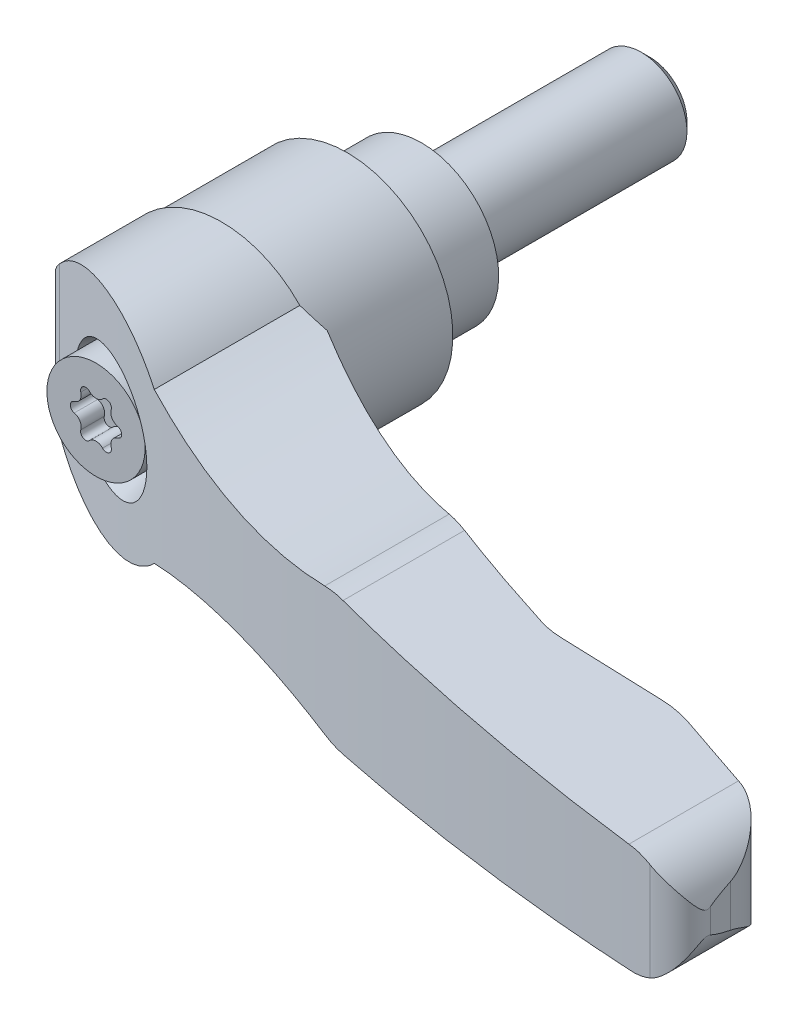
ISO-10303-21;
HEADER;
FILE_DESCRIPTION(('STEP AP214'),'2;1');
FILE_NAME('part.step','',(''),(''),'','','');
FILE_SCHEMA(('AUTOMOTIVE_DESIGN { 1 0 10303 214 1 1 1 1 }'));
ENDSEC;
DATA;
#1=APPLICATION_CONTEXT('core data for automotive mechanical design processes');
#2=APPLICATION_PROTOCOL_DEFINITION('international standard','automotive_design',2000,#1);
#3=PRODUCT_CONTEXT('',#1,'mechanical');
#4=PRODUCT('Part','Part','',(#3));
#5=PRODUCT_RELATED_PRODUCT_CATEGORY('part','',(#4));
#6=PRODUCT_DEFINITION_FORMATION('','',#4);
#7=PRODUCT_DEFINITION_CONTEXT('part definition',#1,'design');
#8=PRODUCT_DEFINITION('design','',#6,#7);
#9=PRODUCT_DEFINITION_SHAPE('','',#8);
#10=(LENGTH_UNIT() NAMED_UNIT(*) SI_UNIT(.MILLI.,.METRE.));
#11=(NAMED_UNIT(*) PLANE_ANGLE_UNIT() SI_UNIT($,.RADIAN.));
#12=(NAMED_UNIT(*) SI_UNIT($,.STERADIAN.) SOLID_ANGLE_UNIT());
#13=UNCERTAINTY_MEASURE_WITH_UNIT(LENGTH_MEASURE(1.E-05),#10,'distance_accuracy_value','');
#14=(GEOMETRIC_REPRESENTATION_CONTEXT(3) GLOBAL_UNCERTAINTY_ASSIGNED_CONTEXT((#13)) GLOBAL_UNIT_ASSIGNED_CONTEXT((#10,
#11,#12)) REPRESENTATION_CONTEXT('',''));
#15=CARTESIAN_POINT('',(0.,0.,0.));
#16=DIRECTION('',(0.,0.,1.));
#17=DIRECTION('',(1.,0.,0.));
#18=AXIS2_PLACEMENT_3D('',#15,#16,#17);
#19=CARTESIAN_POINT('',(0.,0.,-7.116040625));
#20=DIRECTION('',(0.,0.,-1.));
#21=DIRECTION('',(0.,1.,0.));
#22=AXIS2_PLACEMENT_3D('',#19,#20,#21);
#23=CYLINDRICAL_SURFACE('',#22,4.);
#24=CARTESIAN_POINT('',(0.,0.,-19.23));
#25=DIRECTION('',(0.,0.,-1.));
#26=DIRECTION('',(0.,1.,0.));
#27=AXIS2_PLACEMENT_3D('',#24,#25,#26);
#28=CIRCLE('',#27,4.);
#29=CARTESIAN_POINT('',(0.,4.,-19.23));
#30=VERTEX_POINT('',#29);
#31=EDGE_CURVE('E9',#30,#30,#28,.F.);
#32=ORIENTED_EDGE('',*,*,#31,.T.);
#33=EDGE_LOOP('',(#32));
#34=FACE_BOUND('',#33,.T.);
#35=CARTESIAN_POINT('',(0.,0.,0.));
#36=DIRECTION('',(0.,0.,-1.));
#37=DIRECTION('',(0.,1.,0.));
#38=AXIS2_PLACEMENT_3D('',#35,#36,#37);
#39=CIRCLE('',#38,4.);
#40=CARTESIAN_POINT('',(0.,4.,0.));
#41=VERTEX_POINT('',#40);
#42=EDGE_CURVE('E547',#41,#41,#39,.F.);
#43=ORIENTED_EDGE('',*,*,#42,.F.);
#44=EDGE_LOOP('',(#43));
#45=FACE_BOUND('',#44,.T.);
#46=ADVANCED_FACE('F14',(#34,#45),#23,.T.);
#47=CARTESIAN_POINT('',(5.375,0.,0.));
#48=DIRECTION('',(0.,0.,-1.));
#49=DIRECTION('',(0.,1.,0.));
#50=AXIS2_PLACEMENT_3D('',#47,#48,#49);
#51=PLANE('',#50);
#52=ORIENTED_EDGE('',*,*,#42,.T.);
#53=EDGE_LOOP('',(#52));
#54=FACE_BOUND('',#53,.T.);
#55=CARTESIAN_POINT('',(0.,0.,0.));
#56=DIRECTION('',(0.,0.,-1.));
#57=DIRECTION('',(0.,1.,0.));
#58=AXIS2_PLACEMENT_3D('',#55,#56,#57);
#59=CIRCLE('',#58,6.75);
#60=CARTESIAN_POINT('',(0.,6.75,0.));
#61=VERTEX_POINT('',#60);
#62=EDGE_CURVE('E732',#61,#61,#59,.F.);
#63=ORIENTED_EDGE('',*,*,#62,.F.);
#64=EDGE_LOOP('',(#63));
#65=FACE_BOUND('',#64,.T.);
#66=ADVANCED_FACE('F817',(#54,#65),#51,.T.);
#67=CARTESIAN_POINT('',(0.,0.,8.25));
#68=DIRECTION('',(0.,0.,-1.));
#69=DIRECTION('',(0.,1.,0.));
#70=AXIS2_PLACEMENT_3D('',#67,#68,#69);
#71=CYLINDRICAL_SURFACE('',#70,6.75);
#72=ORIENTED_EDGE('',*,*,#62,.T.);
#73=EDGE_LOOP('',(#72));
#74=FACE_BOUND('',#73,.T.);
#75=CARTESIAN_POINT('',(0.,0.,7.15000000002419));
#76=DIRECTION('',(0.,0.,-1.));
#77=DIRECTION('',(1.,0.,0.));
#78=AXIS2_PLACEMENT_3D('',#75,#76,#77);
#79=CIRCLE('',#78,6.74999999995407);
#80=CARTESIAN_POINT('',(6.74999999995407,0.,7.15000000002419));
#81=VERTEX_POINT('',#80);
#82=EDGE_CURVE('E540',#81,#81,#79,.T.);
#83=ORIENTED_EDGE('',*,*,#82,.T.);
#84=EDGE_LOOP('',(#83));
#85=FACE_BOUND('',#84,.T.);
#86=ADVANCED_FACE('F824',(#74,#85),#71,.T.);
#87=CARTESIAN_POINT('',(0.,0.,6.9000000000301));
#88=DIRECTION('',(0.,0.,-1.));
#89=DIRECTION('',(0.,1.,0.));
#90=AXIS2_PLACEMENT_3D('',#87,#88,#89);
#91=CONICAL_SURFACE('',#90,7.000000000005,0.785398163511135);
#92=ORIENTED_EDGE('',*,*,#82,.F.);
#93=EDGE_LOOP('',(#92));
#94=FACE_BOUND('',#93,.T.);
#95=CARTESIAN_POINT('',(0.,0.,6.9));
#96=DIRECTION('',(0.,0.,-1.));
#97=DIRECTION('',(0.,1.,0.));
#98=AXIS2_PLACEMENT_3D('',#95,#96,#97);
#99=CIRCLE('',#98,7.);
#100=CARTESIAN_POINT('',(0.,7.,6.9));
#101=VERTEX_POINT('',#100);
#102=EDGE_CURVE('E536',#101,#101,#99,.T.);
#103=ORIENTED_EDGE('',*,*,#102,.T.);
#104=EDGE_LOOP('',(#103));
#105=FACE_BOUND('',#104,.T.);
#106=ADVANCED_FACE('F832',(#94,#105),#91,.F.);
#107=CARTESIAN_POINT('',(0.,0.,6.2));
#108=DIRECTION('',(0.,0.,-1.));
#109=DIRECTION('',(0.,1.,0.));
#110=AXIS2_PLACEMENT_3D('',#107,#108,#109);
#111=CYLINDRICAL_SURFACE('',#110,7.);
#112=ORIENTED_EDGE('',*,*,#102,.F.);
#113=EDGE_LOOP('',(#112));
#114=FACE_BOUND('',#113,.T.);
#115=CARTESIAN_POINT('',(0.,0.,6.5));
#116=DIRECTION('',(0.,0.,-1.));
#117=DIRECTION('',(0.,1.,0.));
#118=AXIS2_PLACEMENT_3D('',#115,#116,#117);
#119=CIRCLE('',#118,7.);
#120=CARTESIAN_POINT('',(0.,7.,6.5));
#121=VERTEX_POINT('',#120);
#122=EDGE_CURVE('E539',#121,#121,#119,.F.);
#123=ORIENTED_EDGE('',*,*,#122,.F.);
#124=EDGE_LOOP('',(#123));
#125=FACE_BOUND('',#124,.T.);
#126=ADVANCED_FACE('F839',(#114,#125),#111,.F.);
#127=CARTESIAN_POINT('',(-9.01003775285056,-19.,6.5));
#128=DIRECTION('',(0.707106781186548,0.,0.707106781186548));
#129=DIRECTION('',(-0.707106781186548,0.,0.707106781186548));
#130=AXIS2_PLACEMENT_3D('',#127,#128,#129);
#131=PLANE('',#130);
#132=DIRECTION('',(0.,1.,0.));
#133=VECTOR('',#132,1.);
#134=CARTESIAN_POINT('',(-9.01003775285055,0.,6.5));
#135=LINE('',#134,#133);
#136=CARTESIAN_POINT('',(-9.01003775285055,-2.13584185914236,6.5));
#137=VERTEX_POINT('',#136);
#138=CARTESIAN_POINT('',(-9.01003775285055,2.13584185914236,6.5));
#139=VERTEX_POINT('',#138);
#140=EDGE_CURVE('E727',#137,#139,#135,.T.);
#141=ORIENTED_EDGE('',*,*,#140,.F.);
#142=CARTESIAN_POINT('',(-0.00999999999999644,0.,-2.50003775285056));
#143=DIRECTION('',(0.707106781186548,0.,0.707106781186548));
#144=DIRECTION('',(-0.707106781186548,0.,0.707106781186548));
#145=AXIS2_PLACEMENT_3D('',#142,#143,#144);
#146=ELLIPSE('',#145,13.0814754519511,9.25);
#147=EDGE_CURVE('E724',#139,#137,#146,.T.);
#148=ORIENTED_EDGE('',*,*,#147,.F.);
#149=EDGE_LOOP('',(#141,#148));
#150=FACE_BOUND('',#149,.T.);
#151=ADVANCED_FACE('F843',(#150),#131,.F.);
#152=CARTESIAN_POINT('',(-4.635,0.,6.5));
#153=DIRECTION('',(0.,0.,-1.));
#154=DIRECTION('',(0.,1.,0.));
#155=AXIS2_PLACEMENT_3D('',#152,#153,#154);
#156=PLANE('',#155);
#157=ORIENTED_EDGE('',*,*,#140,.T.);
#158=CARTESIAN_POINT('',(-0.00999999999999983,0.,6.5));
#159=DIRECTION('',(0.,0.,1.));
#160=DIRECTION('',(-1.,0.,0.));
#161=AXIS2_PLACEMENT_3D('',#158,#159,#160);
#162=CIRCLE('',#161,9.25);
#163=EDGE_CURVE('E720',#137,#139,#162,.T.);
#164=ORIENTED_EDGE('',*,*,#163,.F.);
#165=EDGE_LOOP('',(#157,#164));
#166=FACE_BOUND('',#165,.T.);
#167=ORIENTED_EDGE('',*,*,#122,.T.);
#168=EDGE_LOOP('',(#167));
#169=FACE_BOUND('',#168,.T.);
#170=ADVANCED_FACE('F847',(#166,#169),#156,.T.);
#171=CARTESIAN_POINT('',(-0.0100000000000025,0.,13.5625));
#172=DIRECTION('',(0.,0.,1.));
#173=DIRECTION('',(-1.,0.,0.));
#174=AXIS2_PLACEMENT_3D('',#171,#172,#173);
#175=CYLINDRICAL_SURFACE('',#174,9.25);
#176=ORIENTED_EDGE('',*,*,#163,.T.);
#177=ORIENTED_EDGE('',*,*,#147,.T.);
#178=EDGE_LOOP('',(#176,#177));
#179=FACE_BOUND('',#178,.T.);
#180=CARTESIAN_POINT('',(-0.010000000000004,0.,17.5));
#181=DIRECTION('',(0.,0.,1.));
#182=DIRECTION('',(-1.,0.,0.));
#183=AXIS2_PLACEMENT_3D('',#180,#181,#182);
#184=CIRCLE('',#183,9.25);
#185=CARTESIAN_POINT('',(-9.26,0.,17.5));
#186=VERTEX_POINT('',#185);
#187=CARTESIAN_POINT('',(9.23999999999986,0.,17.5000000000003));
#188=VERTEX_POINT('',#187);
#189=EDGE_CURVE('E710',#186,#188,#184,.T.);
#190=ORIENTED_EDGE('',*,*,#189,.F.);
#191=CARTESIAN_POINT('',(-0.010000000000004,0.,17.5));
#192=DIRECTION('',(0.,0.,1.));
#193=DIRECTION('',(-1.,0.,0.));
#194=AXIS2_PLACEMENT_3D('',#191,#192,#193);
#195=CIRCLE('',#194,9.25);
#196=EDGE_CURVE('E531',#188,#186,#195,.T.);
#197=ORIENTED_EDGE('',*,*,#196,.F.);
#198=EDGE_LOOP('',(#190,#197));
#199=FACE_BOUND('',#198,.T.);
#200=ADVANCED_FACE('F717',(#179,#199),#175,.T.);
#201=CARTESIAN_POINT('',(64.6274051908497,-10.5,37.5817950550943));
#202=DIRECTION('',(0.992331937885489,0.,-0.123601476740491));
#203=DIRECTION('',(0.123601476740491,0.,0.992331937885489));
#204=AXIS2_PLACEMENT_3D('',#201,#202,#203);
#205=PLANE('',#204);
#206=CARTESIAN_POINT('',(60.25,0.,2.43788666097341));
#207=DIRECTION('',(0.992331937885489,0.,-0.123601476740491));
#208=DIRECTION('',(0.123601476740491,0.,0.992331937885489));
#209=AXIS2_PLACEMENT_3D('',#206,#207,#208);
#210=ELLIPSE('',#209,38.4299615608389,4.75);
#211=CARTESIAN_POINT('',(64.8745408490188,1.08449155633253,39.5659186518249));
#212=VERTEX_POINT('',#211);
#213=CARTESIAN_POINT('',(64.6274051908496,1.84413226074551,37.5817950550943));
#214=VERTEX_POINT('',#213);
#215=EDGE_CURVE('E421',#212,#214,#210,.F.);
#216=ORIENTED_EDGE('',*,*,#215,.F.);
#217=DIRECTION('',(0.,-1.,0.));
#218=VECTOR('',#217,1.);
#219=CARTESIAN_POINT('',(64.8745408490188,-10.5,39.5659186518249));
#220=LINE('',#219,#218);
#221=CARTESIAN_POINT('',(64.8745408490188,-1.08449155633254,39.5659186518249));
#222=VERTEX_POINT('',#221);
#223=EDGE_CURVE('E460',#222,#212,#220,.F.);
#224=ORIENTED_EDGE('',*,*,#223,.F.);
#225=CARTESIAN_POINT('',(60.25,0.,2.43788666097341));
#226=DIRECTION('',(0.992331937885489,0.,-0.123601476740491));
#227=DIRECTION('',(0.123601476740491,0.,0.992331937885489));
#228=AXIS2_PLACEMENT_3D('',#225,#226,#227);
#229=ELLIPSE('',#228,38.4299615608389,4.75);
#230=CARTESIAN_POINT('',(64.6274051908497,-1.84413226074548,37.5817950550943));
#231=VERTEX_POINT('',#230);
#232=EDGE_CURVE('E444',#231,#222,#229,.F.);
#233=ORIENTED_EDGE('',*,*,#232,.F.);
#234=DIRECTION('',(0.,-1.,0.));
#235=VECTOR('',#234,1.);
#236=CARTESIAN_POINT('',(64.6274051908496,-10.5,37.5817950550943));
#237=LINE('',#236,#235);
#238=EDGE_CURVE('E718',#214,#231,#237,.T.);
#239=ORIENTED_EDGE('',*,*,#238,.F.);
#240=EDGE_LOOP('',(#216,#224,#233,#239));
#241=FACE_BOUND('',#240,.T.);
#242=ADVANCED_FACE('F430',(#241),#205,.T.);
#243=CARTESIAN_POINT('',(58.6337202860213,-10.5,38.3283479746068));
#244=DIRECTION('',(0.,-1.,0.));
#245=DIRECTION('',(1.,0.,0.));
#246=AXIS2_PLACEMENT_3D('',#243,#244,#245);
#247=CYLINDRICAL_SURFACE('',#246,6.04);
#248=CARTESIAN_POINT('',(64.6274051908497,1.84413226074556,37.5817950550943));
#249=CARTESIAN_POINT('',(64.6175868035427,1.86745330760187,37.5030045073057));
#250=CARTESIAN_POINT('',(64.6063375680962,1.89362327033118,37.4253204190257));
#251=CARTESIAN_POINT('',(64.5811702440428,1.95049016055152,37.2721928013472));
#252=CARTESIAN_POINT('',(64.5672561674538,1.98118026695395,37.1967460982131));
#253=CARTESIAN_POINT('',(64.5369883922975,2.04585034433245,37.0482136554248));
#254=CARTESIAN_POINT('',(64.520645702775,2.07981523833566,36.9751189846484));
#255=CARTESIAN_POINT('',(64.4855821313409,2.15032519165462,36.8307396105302));
#256=CARTESIAN_POINT('',(64.4668602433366,2.18687133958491,36.7594556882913));
#257=CARTESIAN_POINT('',(64.4072221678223,2.29938724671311,36.547961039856));
#258=CARTESIAN_POINT('',(64.3628565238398,2.37818379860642,36.410218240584));
#259=CARTESIAN_POINT('',(64.2652007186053,2.53960895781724,36.1400450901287));
#260=CARTESIAN_POINT('',(64.2118976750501,2.6222429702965,36.007622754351));
#261=CARTESIAN_POINT('',(64.077119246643,2.81672317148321,35.7040219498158));
#262=CARTESIAN_POINT('',(63.9921849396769,2.92909268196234,35.5347005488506));
#263=CARTESIAN_POINT('',(63.8063278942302,3.15216626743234,35.2039790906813));
#264=CARTESIAN_POINT('',(63.7054078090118,3.26287061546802,35.0425777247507));
#265=CARTESIAN_POINT('',(63.4870671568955,3.47959027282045,34.7278934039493));
#266=CARTESIAN_POINT('',(63.369645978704,3.58560540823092,34.5746107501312));
#267=CARTESIAN_POINT('',(63.1179209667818,3.78996521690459,34.277236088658));
#268=CARTESIAN_POINT('',(62.9836257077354,3.88831374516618,34.1331394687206));
#269=CARTESIAN_POINT('',(62.6561598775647,4.10136712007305,33.815313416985));
#270=CARTESIAN_POINT('',(62.4571888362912,4.21258905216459,33.6450495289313));
#271=CARTESIAN_POINT('',(62.1378586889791,4.36029911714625,33.4069452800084));
#272=CARTESIAN_POINT('',(62.0281124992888,4.40629516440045,33.3305585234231));
#273=CARTESIAN_POINT('',(61.8018114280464,4.49098569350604,33.1841350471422));
#274=CARTESIAN_POINT('',(61.6852609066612,4.52968478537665,33.1140943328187));
#275=CARTESIAN_POINT('',(61.4786111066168,4.58924867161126,32.9993621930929));
#276=CARTESIAN_POINT('',(61.3900115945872,4.61209493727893,32.9529824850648));
#277=CARTESIAN_POINT('',(61.2097340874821,4.65295056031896,32.8642982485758));
#278=CARTESIAN_POINT('',(61.1180570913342,4.67096147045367,32.82199241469));
#279=CARTESIAN_POINT('',(60.9313596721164,4.70183469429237,32.7415027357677));
#280=CARTESIAN_POINT('',(60.8363219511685,4.71466416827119,32.7033462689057));
#281=CARTESIAN_POINT('',(60.6438287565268,4.73463763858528,32.631712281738));
#282=CARTESIAN_POINT('',(60.5463713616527,4.74177695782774,32.5982386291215));
#283=CARTESIAN_POINT('',(60.4479724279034,4.74587261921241,32.5672639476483));
#284=B_SPLINE_CURVE_WITH_KNOTS('',3,(#248,#249,#250,#251,#252,#253,#254,#255,#256,#257,#258,
#259,#260,#261,#262,#263,#264,#265,#266,#267,#268,#269,#270,#271,#272,#273,#274,#275,#276,#277,
#278,#279,#280,#281,#282,#283),.UNSPECIFIED.,.F.,.F.,(4,2,2,2,2,2,2,2,2,2,2,2,2,2,2,2,2,4),(0.,
0.248076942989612,0.495783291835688,0.742399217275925,0.989119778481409,1.48293160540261,
1.97746142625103,2.63745339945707,3.29733594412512,3.95724294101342,4.61681594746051,
5.46693586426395,5.89075482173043,6.31430511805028,6.62183365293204,6.92926331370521,
7.23861197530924,7.54821464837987),.UNSPECIFIED.);
#285=CARTESIAN_POINT('',(60.4479724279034,4.74587261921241,32.5672639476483));
#286=VERTEX_POINT('',#285);
#287=EDGE_CURVE('E412',#214,#286,#284,.T.);
#288=ORIENTED_EDGE('',*,*,#287,.F.);
#289=ORIENTED_EDGE('',*,*,#238,.T.);
#290=CARTESIAN_POINT('',(60.4479724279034,-4.74587261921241,32.5672639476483));
#291=CARTESIAN_POINT('',(60.5755504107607,-4.74057354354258,32.6074069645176));
#292=CARTESIAN_POINT('',(60.7015088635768,-4.73014540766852,32.6517620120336));
#293=CARTESIAN_POINT('',(60.9490652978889,-4.69992242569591,32.7481786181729));
#294=CARTESIAN_POINT('',(61.0706698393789,-4.6801423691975,32.8002279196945));
#295=CARTESIAN_POINT('',(61.3074659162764,-4.63235500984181,32.9108206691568));
#296=CARTESIAN_POINT('',(61.4227141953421,-4.60444273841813,32.9692844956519));
#297=CARTESIAN_POINT('',(61.6477173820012,-4.54120548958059,33.0925213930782));
#298=CARTESIAN_POINT('',(61.7574696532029,-4.50587699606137,33.1572974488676));
#299=CARTESIAN_POINT('',(61.9940137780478,-4.42040174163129,33.307032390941));
#300=CARTESIAN_POINT('',(62.1193938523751,-4.36870213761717,33.3933358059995));
#301=CARTESIAN_POINT('',(62.3610721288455,-4.25718277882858,33.5732278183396));
#302=CARTESIAN_POINT('',(62.4773638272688,-4.19735729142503,33.6668215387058));
#303=CARTESIAN_POINT('',(62.7012840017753,-4.07066877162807,33.8608437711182));
#304=CARTESIAN_POINT('',(62.8088611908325,-4.0037687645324,33.9613071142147));
#305=CARTESIAN_POINT('',(63.0146476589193,-3.86453813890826,34.1677809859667));
#306=CARTESIAN_POINT('',(63.1128596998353,-3.79220913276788,34.2737898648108));
#307=CARTESIAN_POINT('',(63.3331746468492,-3.61700510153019,34.5290929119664));
#308=CARTESIAN_POINT('',(63.4514763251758,-3.51235864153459,34.6804594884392));
#309=CARTESIAN_POINT('',(63.6718053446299,-3.29808480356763,34.9913387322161));
#310=CARTESIAN_POINT('',(63.7738256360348,-3.18845529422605,35.1508548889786));
#311=CARTESIAN_POINT('',(63.961662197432,-2.9676568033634,35.4770445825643));
#312=CARTESIAN_POINT('',(64.0475378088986,-2.85649513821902,35.6436890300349));
#313=CARTESIAN_POINT('',(64.2038484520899,-2.63586419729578,35.9851508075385));
#314=CARTESIAN_POINT('',(64.2742871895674,-2.52639452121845,36.1599661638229));
#315=CARTESIAN_POINT('',(64.3705847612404,-2.36382517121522,36.4361542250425));
#316=CARTESIAN_POINT('',(64.4019853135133,-2.30809068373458,36.5340606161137));
#317=CARTESIAN_POINT('',(64.4601539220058,-2.20019362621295,36.7330390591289));
#318=CARTESIAN_POINT('',(64.4869269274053,-2.14802727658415,36.8341075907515));
#319=CARTESIAN_POINT('',(64.5357331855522,-2.04890785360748,37.0402846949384));
#320=CARTESIAN_POINT('',(64.5577546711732,-2.00196785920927,37.1454025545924));
#321=CARTESIAN_POINT('',(64.596614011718,-1.91618262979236,37.360168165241));
#322=CARTESIAN_POINT('',(64.6134353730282,-1.87736327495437,37.4698291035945));
#323=CARTESIAN_POINT('',(64.6274051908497,-1.84413226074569,37.5817950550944));
#324=B_SPLINE_CURVE_WITH_KNOTS('',3,(#290,#291,#292,#293,#294,#295,#296,#297,#298,#299,#300,
#301,#302,#303,#304,#305,#306,#307,#308,#309,#310,#311,#312,#313,#314,#315,#316,#317,#318,#319,
#320,#321,#322,#323),.UNSPECIFIED.,.F.,.F.,(4,2,2,2,2,2,2,2,2,2,2,2,2,2,2,2,4),(0.,
0.401264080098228,0.801895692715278,1.19802151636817,1.59433557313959,2.0758833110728,
2.55777255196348,3.04231807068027,3.52672024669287,4.18208013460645,4.83772302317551,
5.49090678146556,6.1439335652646,6.49464389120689,6.84497677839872,7.19616755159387,
7.54846105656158),.UNSPECIFIED.);
#325=CARTESIAN_POINT('',(60.4479724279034,-4.74587261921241,32.5672639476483));
#326=VERTEX_POINT('',#325);
#327=EDGE_CURVE('E436',#326,#231,#324,.T.);
#328=ORIENTED_EDGE('',*,*,#327,.F.);
#329=DIRECTION('',(0.,-1.,0.));
#330=VECTOR('',#329,1.);
#331=CARTESIAN_POINT('',(60.4479724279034,-10.5,32.5672639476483));
#332=LINE('',#331,#330);
#333=EDGE_CURVE('E526',#286,#326,#332,.T.);
#334=ORIENTED_EDGE('',*,*,#333,.F.);
#335=EDGE_LOOP('',(#288,#289,#328,#334));
#336=FACE_BOUND('',#335,.T.);
#337=ADVANCED_FACE('F424',(#336),#247,.T.);
#338=CARTESIAN_POINT('',(-9.26,-10.5,17.5));
#339=DIRECTION('',(0.,0.,-1.));
#340=DIRECTION('',(0.,1.,0.));
#341=AXIS2_PLACEMENT_3D('',#338,#339,#340);
#342=PLANE('',#341);
#343=DIRECTION('',(0.,-1.,0.));
#344=VECTOR('',#343,1.);
#345=CARTESIAN_POINT('',(-9.26,-10.5,17.5));
#346=LINE('',#345,#344);
#347=CARTESIAN_POINT('',(-9.26,2.12188595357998,17.5));
#348=VERTEX_POINT('',#347);
#349=EDGE_CURVE('E527',#348,#186,#346,.T.);
#350=ORIENTED_EDGE('',*,*,#349,.F.);
#351=CARTESIAN_POINT('',(0.,0.,17.5));
#352=DIRECTION('',(0.,0.,1.));
#353=DIRECTION('',(0.,-1.,0.));
#354=AXIS2_PLACEMENT_3D('',#351,#352,#353);
#355=CIRCLE('',#354,9.5);
#356=CARTESIAN_POINT('',(6.84374087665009,6.58887022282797,17.5));
#357=VERTEX_POINT('',#356);
#358=EDGE_CURVE('E338',#357,#348,#355,.T.);
#359=ORIENTED_EDGE('',*,*,#358,.F.);
#360=CARTESIAN_POINT('',(19.25,44.09,17.5));
#361=DIRECTION('',(0.,0.,1.));
#362=DIRECTION('',(0.,-1.,0.));
#363=AXIS2_PLACEMENT_3D('',#360,#361,#362);
#364=CIRCLE('',#363,39.5);
#365=CARTESIAN_POINT('',(9.23999999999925,5.87940068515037,17.5000000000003));
#366=VERTEX_POINT('',#365);
#367=EDGE_CURVE('E339',#357,#366,#364,.T.);
#368=ORIENTED_EDGE('',*,*,#367,.T.);
#369=DIRECTION('',(0.,-1.,0.));
#370=VECTOR('',#369,1.);
#371=CARTESIAN_POINT('',(9.23999999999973,-10.5,17.5000000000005));
#372=LINE('',#371,#370);
#373=EDGE_CURVE('E471',#366,#188,#372,.T.);
#374=ORIENTED_EDGE('',*,*,#373,.T.);
#375=ORIENTED_EDGE('',*,*,#196,.T.);
#376=EDGE_LOOP('',(#350,#359,#368,#374,#375));
#377=FACE_BOUND('',#376,.T.);
#378=ADVANCED_FACE('F429',(#377),#342,.T.);
#379=CARTESIAN_POINT('',(-9.26,-10.5,21.2038249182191));
#380=DIRECTION('',(-1.,0.,0.));
#381=DIRECTION('',(0.,-1.,0.));
#382=AXIS2_PLACEMENT_3D('',#379,#380,#381);
#383=PLANE('',#382);
#384=ORIENTED_EDGE('',*,*,#349,.T.);
#385=DIRECTION('',(0.,1.,0.));
#386=VECTOR('',#385,1.);
#387=CARTESIAN_POINT('',(-9.26,-10.5,17.5));
#388=LINE('',#387,#386);
#389=CARTESIAN_POINT('',(-9.26,-2.12188595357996,17.5));
#390=VERTEX_POINT('',#389);
#391=EDGE_CURVE('E706',#390,#186,#388,.T.);
#392=ORIENTED_EDGE('',*,*,#391,.F.);
#393=DIRECTION('',(0.,0.,1.));
#394=VECTOR('',#393,1.);
#395=CARTESIAN_POINT('',(-9.26,-2.12188595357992,42.5));
#396=LINE('',#395,#394);
#397=CARTESIAN_POINT('',(-9.26,-2.12188595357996,21.2038249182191));
#398=VERTEX_POINT('',#397);
#399=EDGE_CURVE('E530',#398,#390,#396,.F.);
#400=ORIENTED_EDGE('',*,*,#399,.F.);
#401=DIRECTION('',(0.,-1.,0.));
#402=VECTOR('',#401,1.);
#403=CARTESIAN_POINT('',(-9.26,-10.5,21.2038249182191));
#404=LINE('',#403,#402);
#405=CARTESIAN_POINT('',(-9.26,2.12188595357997,21.2038249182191));
#406=VERTEX_POINT('',#405);
#407=EDGE_CURVE('E493',#406,#398,#404,.T.);
#408=ORIENTED_EDGE('',*,*,#407,.F.);
#409=DIRECTION('',(0.,0.,1.));
#410=VECTOR('',#409,1.);
#411=CARTESIAN_POINT('',(-9.26,2.12188595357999,42.5));
#412=LINE('',#411,#410);
#413=EDGE_CURVE('E491',#348,#406,#412,.T.);
#414=ORIENTED_EDGE('',*,*,#413,.F.);
#415=EDGE_LOOP('',(#384,#392,#400,#408,#414));
#416=FACE_BOUND('',#415,.T.);
#417=ADVANCED_FACE('F708',(#416),#383,.T.);
#418=CARTESIAN_POINT('',(-9.26,-10.5,17.5));
#419=DIRECTION('',(0.,0.,-1.));
#420=DIRECTION('',(0.,1.,0.));
#421=AXIS2_PLACEMENT_3D('',#418,#419,#420);
#422=PLANE('',#421);
#423=DIRECTION('',(0.,-1.,0.));
#424=VECTOR('',#423,1.);
#425=CARTESIAN_POINT('',(9.23999999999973,-10.5,17.5000000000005));
#426=LINE('',#425,#424);
#427=CARTESIAN_POINT('',(9.23999999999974,-5.87940068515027,17.5000000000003));
#428=VERTEX_POINT('',#427);
#429=EDGE_CURVE('E639',#188,#428,#426,.T.);
#430=ORIENTED_EDGE('',*,*,#429,.T.);
#431=CARTESIAN_POINT('',(19.25,-44.09,17.5));
#432=DIRECTION('',(0.,0.,1.));
#433=DIRECTION('',(0.,-1.,0.));
#434=AXIS2_PLACEMENT_3D('',#431,#432,#433);
#435=CIRCLE('',#434,39.5);
#436=CARTESIAN_POINT('',(6.84374087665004,-6.588870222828,17.5));
#437=VERTEX_POINT('',#436);
#438=EDGE_CURVE('E305',#428,#437,#435,.T.);
#439=ORIENTED_EDGE('',*,*,#438,.T.);
#440=CARTESIAN_POINT('',(0.,0.,17.5));
#441=DIRECTION('',(0.,0.,1.));
#442=DIRECTION('',(0.,-1.,0.));
#443=AXIS2_PLACEMENT_3D('',#440,#441,#442);
#444=CIRCLE('',#443,9.5);
#445=EDGE_CURVE('E496',#390,#437,#444,.T.);
#446=ORIENTED_EDGE('',*,*,#445,.F.);
#447=ORIENTED_EDGE('',*,*,#391,.T.);
#448=ORIENTED_EDGE('',*,*,#189,.T.);
#449=EDGE_LOOP('',(#430,#439,#446,#447,#448));
#450=FACE_BOUND('',#449,.T.);
#451=ADVANCED_FACE('F701',(#450),#422,.T.);
#452=CARTESIAN_POINT('',(53.8294507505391,-10.5,30.4829917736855));
#453=DIRECTION('',(0.300372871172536,0.,-0.95382185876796));
#454=DIRECTION('',(0.95382185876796,0.,0.300372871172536));
#455=AXIS2_PLACEMENT_3D('',#452,#453,#454);
#456=PLANE('',#455);
#457=CARTESIAN_POINT('',(60.25,0.,32.5049194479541));
#458=DIRECTION('',(0.300372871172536,0.,-0.95382185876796));
#459=DIRECTION('',(0.95382185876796,0.,0.300372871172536));
#460=AXIS2_PLACEMENT_3D('',#457,#458,#459);
#461=ELLIPSE('',#460,4.97996555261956,4.75);
#462=CARTESIAN_POINT('',(60.25,4.75,32.5049194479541));
#463=VERTEX_POINT('',#462);
#464=EDGE_CURVE('E461',#286,#463,#461,.F.);
#465=ORIENTED_EDGE('',*,*,#464,.F.);
#466=ORIENTED_EDGE('',*,*,#333,.T.);
#467=CARTESIAN_POINT('',(60.25,0.,32.5049194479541));
#468=DIRECTION('',(0.300372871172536,0.,-0.95382185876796));
#469=DIRECTION('',(0.95382185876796,0.,0.300372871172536));
#470=AXIS2_PLACEMENT_3D('',#467,#468,#469);
#471=ELLIPSE('',#470,4.97996555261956,4.75);
#472=CARTESIAN_POINT('',(60.25,-4.75,32.5049194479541));
#473=VERTEX_POINT('',#472);
#474=EDGE_CURVE('E445',#473,#326,#471,.F.);
#475=ORIENTED_EDGE('',*,*,#474,.F.);
#476=DIRECTION('',(-0.953255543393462,-0.0344545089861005,-0.300194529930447));
#477=VECTOR('',#476,1.);
#478=CARTESIAN_POINT('',(60.25,-4.75,32.5049194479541));
#479=LINE('',#478,#477);
#480=CARTESIAN_POINT('',(53.8294507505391,-4.98206460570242,30.4829917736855));
#481=VERTEX_POINT('',#480);
#482=EDGE_CURVE('E508',#473,#481,#479,.T.);
#483=ORIENTED_EDGE('',*,*,#482,.T.);
#484=DIRECTION('',(0.,-1.,0.));
#485=VECTOR('',#484,1.);
#486=CARTESIAN_POINT('',(53.8294507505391,-10.5,30.4829917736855));
#487=LINE('',#486,#485);
#488=CARTESIAN_POINT('',(53.8294507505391,4.98206460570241,30.4829917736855));
#489=VERTEX_POINT('',#488);
#490=EDGE_CURVE('E523',#489,#481,#487,.T.);
#491=ORIENTED_EDGE('',*,*,#490,.F.);
#492=DIRECTION('',(0.953255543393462,-0.0344545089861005,0.300194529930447));
#493=VECTOR('',#492,1.);
#494=CARTESIAN_POINT('',(53.8294507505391,4.98206460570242,30.4829917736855));
#495=LINE('',#494,#493);
#496=EDGE_CURVE('E473',#489,#463,#495,.T.);
#497=ORIENTED_EDGE('',*,*,#496,.T.);
#498=EDGE_LOOP('',(#465,#466,#475,#483,#491,#497));
#499=FACE_BOUND('',#498,.T.);
#500=ADVANCED_FACE('F868',(#499),#456,.T.);
#501=CARTESIAN_POINT('',(51.0780352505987,-10.5,39.22));
#502=DIRECTION('',(0.,-1.,0.));
#503=DIRECTION('',(1.,0.,0.));
#504=AXIS2_PLACEMENT_3D('',#501,#502,#503);
#505=CYLINDRICAL_SURFACE('',#504,9.15999999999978);
#506=CARTESIAN_POINT('',(51.0780352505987,5.08151188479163,39.22));
#507=DIRECTION('',(-0.0361204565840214,-0.999347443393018,0.));
#508=DIRECTION('',(0.999347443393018,-0.0361204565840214,0.));
#509=AXIS2_PLACEMENT_3D('',#506,#507,#508);
#510=ELLIPSE('',#509,9.16598132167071,9.15999999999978);
#511=CARTESIAN_POINT('',(51.0780352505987,5.08151188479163,30.06));
#512=VERTEX_POINT('',#511);
#513=EDGE_CURVE('E476',#512,#489,#510,.T.);
#514=ORIENTED_EDGE('',*,*,#513,.T.);
#515=ORIENTED_EDGE('',*,*,#490,.T.);
#516=CARTESIAN_POINT('',(51.0780352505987,-5.08151188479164,39.22));
#517=DIRECTION('',(-0.0361204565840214,0.999347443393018,0.));
#518=DIRECTION('',(-0.999347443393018,-0.0361204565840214,0.));
#519=AXIS2_PLACEMENT_3D('',#516,#517,#518);
#520=ELLIPSE('',#519,9.16598132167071,9.15999999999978);
#521=CARTESIAN_POINT('',(51.0780352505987,-5.08151188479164,30.06));
#522=VERTEX_POINT('',#521);
#523=EDGE_CURVE('E303',#481,#522,#520,.T.);
#524=ORIENTED_EDGE('',*,*,#523,.T.);
#525=DIRECTION('',(0.,1.,0.));
#526=VECTOR('',#525,1.);
#527=CARTESIAN_POINT('',(51.0780352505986,-10.5,30.06));
#528=LINE('',#527,#526);
#529=EDGE_CURVE('E520',#512,#522,#528,.F.);
#530=ORIENTED_EDGE('',*,*,#529,.F.);
#531=EDGE_LOOP('',(#514,#515,#524,#530));
#532=FACE_BOUND('',#531,.T.);
#533=ADVANCED_FACE('F877',(#532),#505,.T.);
#534=CARTESIAN_POINT('',(42.239481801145,-10.5,30.06));
#535=DIRECTION('',(0.,0.,-1.));
#536=DIRECTION('',(0.,1.,0.));
#537=AXIS2_PLACEMENT_3D('',#534,#535,#536);
#538=PLANE('',#537);
#539=DIRECTION('',(0.999347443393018,-0.0361204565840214,0.));
#540=VECTOR('',#539,1.);
#541=CARTESIAN_POINT('',(30.3472861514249,5.83080496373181,30.06));
#542=LINE('',#541,#540);
#543=CARTESIAN_POINT('',(42.239481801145,5.4009729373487,30.06));
#544=VERTEX_POINT('',#543);
#545=EDGE_CURVE('E477',#544,#512,#542,.T.);
#546=ORIENTED_EDGE('',*,*,#545,.T.);
#547=ORIENTED_EDGE('',*,*,#529,.T.);
#548=DIRECTION('',(-0.999347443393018,-0.0361204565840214,0.));
#549=VECTOR('',#548,1.);
#550=CARTESIAN_POINT('',(60.25,-4.75,30.06));
#551=LINE('',#550,#549);
#552=CARTESIAN_POINT('',(42.239481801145,-5.4009729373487,30.06));
#553=VERTEX_POINT('',#552);
#554=EDGE_CURVE('E505',#522,#553,#551,.T.);
#555=ORIENTED_EDGE('',*,*,#554,.T.);
#556=DIRECTION('',(0.,-1.,0.));
#557=VECTOR('',#556,1.);
#558=CARTESIAN_POINT('',(42.239481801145,-10.5,30.06));
#559=LINE('',#558,#557);
#560=EDGE_CURVE('E518',#553,#544,#559,.F.);
#561=ORIENTED_EDGE('',*,*,#560,.T.);
#562=EDGE_LOOP('',(#546,#547,#555,#561));
#563=FACE_BOUND('',#562,.T.);
#564=ADVANCED_FACE('F880',(#563),#538,.T.);
#565=CARTESIAN_POINT('',(42.2394818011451,-10.5,23.0799999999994));
#566=DIRECTION('',(0.,-1.,0.));
#567=DIRECTION('',(1.,0.,0.));
#568=AXIS2_PLACEMENT_3D('',#565,#566,#567);
#569=CYLINDRICAL_SURFACE('',#568,6.98000000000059);
#570=DIRECTION('',(0.,-1.,0.));
#571=VECTOR('',#570,1.);
#572=CARTESIAN_POINT('',(40.3024609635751,-10.5,29.785844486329));
#573=LINE('',#572,#571);
#574=CARTESIAN_POINT('',(40.3024609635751,-5.47098470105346,29.7858444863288));
#575=VERTEX_POINT('',#574);
#576=CARTESIAN_POINT('',(40.3024609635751,5.47098470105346,29.7858444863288));
#577=VERTEX_POINT('',#576);
#578=EDGE_CURVE('E535',#575,#577,#573,.F.);
#579=ORIENTED_EDGE('',*,*,#578,.T.);
#580=CARTESIAN_POINT('',(42.2394818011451,5.40097293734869,23.0799999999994));
#581=DIRECTION('',(-0.0361204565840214,-0.999347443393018,0.));
#582=DIRECTION('',(0.999347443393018,-0.0361204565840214,0.));
#583=AXIS2_PLACEMENT_3D('',#580,#581,#582);
#584=ELLIPSE('',#583,6.98455781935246,6.98000000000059);
#585=EDGE_CURVE('E480',#577,#544,#584,.F.);
#586=ORIENTED_EDGE('',*,*,#585,.T.);
#587=ORIENTED_EDGE('',*,*,#560,.F.);
#588=CARTESIAN_POINT('',(42.2394818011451,-5.4009729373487,23.0799999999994));
#589=DIRECTION('',(-0.0361204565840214,0.999347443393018,0.));
#590=DIRECTION('',(-0.999347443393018,-0.0361204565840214,0.));
#591=AXIS2_PLACEMENT_3D('',#588,#589,#590);
#592=ELLIPSE('',#591,6.98455781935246,6.98000000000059);
#593=EDGE_CURVE('E507',#553,#575,#592,.F.);
#594=ORIENTED_EDGE('',*,*,#593,.T.);
#595=EDGE_LOOP('',(#579,#586,#587,#594));
#596=FACE_BOUND('',#595,.T.);
#597=ADVANCED_FACE('F313',(#596),#569,.F.);
#598=CARTESIAN_POINT('',(88.9416647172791,-10.5,-138.600024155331));
#599=DIRECTION('',(0.,-1.,0.));
#600=DIRECTION('',(1.,0.,0.));
#601=AXIS2_PLACEMENT_3D('',#598,#599,#600);
#602=CYLINDRICAL_SURFACE('',#601,175.27);
#603=CARTESIAN_POINT('',(30.3472861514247,5.83080496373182,26.5855433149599));
#604=CARTESIAN_POINT('',(30.1696679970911,5.83722947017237,26.5225405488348));
#605=CARTESIAN_POINT('',(29.9919650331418,5.83772087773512,26.45918181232));
#606=CARTESIAN_POINT('',(29.6377732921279,5.82691956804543,26.3322542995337));
#607=CARTESIAN_POINT('',(29.461282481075,5.81567269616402,26.2686872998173));
#608=CARTESIAN_POINT('',(29.1095062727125,5.78152581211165,26.1413510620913));
#609=CARTESIAN_POINT('',(28.9342208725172,5.75862582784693,26.0775818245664));
#610=CARTESIAN_POINT('',(28.5848474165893,5.70116062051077,25.9498538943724));
#611=CARTESIAN_POINT('',(28.4107667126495,5.6665501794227,25.8858954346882));
#612=CARTESIAN_POINT('',(28.2379732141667,5.62616845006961,25.8220994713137));
#613=B_SPLINE_CURVE_WITH_KNOTS('',3,(#603,#604,#605,#606,#607,#608,#609,#610,#611,#612),
.UNSPECIFIED.,.F.,.F.,(4,2,2,2,4),(0.,0.565613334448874,1.1290258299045,1.69243697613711,
2.2580489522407),.UNSPECIFIED.);
#614=CARTESIAN_POINT('',(30.3472861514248,5.83080496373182,26.5855433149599));
#615=VERTEX_POINT('',#614);
#616=CARTESIAN_POINT('',(28.2379732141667,5.62616845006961,25.8220994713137));
#617=VERTEX_POINT('',#616);
#618=EDGE_CURVE('E475',#615,#617,#613,.T.);
#619=ORIENTED_EDGE('',*,*,#618,.F.);
#620=CARTESIAN_POINT('',(88.9416647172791,3.71296724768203,-138.600024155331));
#621=DIRECTION('',(-0.0361204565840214,-0.999347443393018,0.));
#622=DIRECTION('',(0.999347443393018,-0.0361204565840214,0.));
#623=AXIS2_PLACEMENT_3D('',#620,#621,#622);
#624=ELLIPSE('',#623,175.384448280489,175.27);
#625=EDGE_CURVE('E422',#615,#577,#624,.F.);
#626=ORIENTED_EDGE('',*,*,#625,.T.);
#627=ORIENTED_EDGE('',*,*,#578,.F.);
#628=CARTESIAN_POINT('',(88.9416647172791,-3.71296724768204,-138.600024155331));
#629=DIRECTION('',(-0.0361204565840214,0.999347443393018,0.));
#630=DIRECTION('',(-0.999347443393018,-0.0361204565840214,0.));
#631=AXIS2_PLACEMENT_3D('',#628,#629,#630);
#632=ELLIPSE('',#631,175.384448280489,175.27);
#633=CARTESIAN_POINT('',(30.3472861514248,-5.83080496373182,26.5855433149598));
#634=VERTEX_POINT('',#633);
#635=EDGE_CURVE('E504',#575,#634,#632,.F.);
#636=ORIENTED_EDGE('',*,*,#635,.T.);
#637=CARTESIAN_POINT('',(28.237973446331,-5.6261685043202,25.8220995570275));
#638=CARTESIAN_POINT('',(28.4107669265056,-5.66655022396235,25.8858955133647));
#639=CARTESIAN_POINT('',(28.584847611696,-5.70116065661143,25.9498539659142));
#640=CARTESIAN_POINT('',(28.9342210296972,-5.75862584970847,26.0775818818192));
#641=CARTESIAN_POINT('',(29.1095064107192,-5.78152582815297,26.1413511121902));
#642=CARTESIAN_POINT('',(29.461282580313,-5.81567270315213,26.2686873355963));
#643=CARTESIAN_POINT('',(29.6377733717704,-5.82691957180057,26.3322543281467));
#644=CARTESIAN_POINT('',(29.9919650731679,-5.83772087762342,26.4591818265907));
#645=CARTESIAN_POINT('',(30.169668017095,-5.83722946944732,26.5225405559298));
#646=CARTESIAN_POINT('',(30.3472861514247,-5.83080496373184,26.5855433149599));
#647=B_SPLINE_CURVE_WITH_KNOTS('',3,(#637,#638,#639,#640,#641,#642,#643,#644,#645,#646),
.UNSPECIFIED.,.F.,.F.,(4,2,2,2,4),(0.,0.565611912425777,1.12902299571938,1.69243542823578,
2.25804869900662),.UNSPECIFIED.);
#648=CARTESIAN_POINT('',(28.237973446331,-5.6261685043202,25.8220995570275));
#649=VERTEX_POINT('',#648);
#650=EDGE_CURVE('E293',#649,#634,#647,.T.);
#651=ORIENTED_EDGE('',*,*,#650,.F.);
#652=CARTESIAN_POINT('',(28.237973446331,-5.6261685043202,25.8220995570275));
#653=CARTESIAN_POINT('',(27.6467124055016,-5.48799745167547,25.6038196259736));
#654=CARTESIAN_POINT('',(27.0537779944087,-5.36383084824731,25.3812778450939));
#655=CARTESIAN_POINT('',(25.8659006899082,-5.14331117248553,24.9280288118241));
#656=CARTESIAN_POINT('',(25.2709579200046,-5.04695642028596,24.6973220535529));
#657=CARTESIAN_POINT('',(24.0803912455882,-4.88185687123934,24.2280988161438));
#658=CARTESIAN_POINT('',(23.4847674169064,-4.81310925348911,23.9895831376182));
#659=CARTESIAN_POINT('',(22.2940534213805,-4.70292970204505,23.5051335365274));
#660=CARTESIAN_POINT('',(21.6989632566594,-4.66149787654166,23.2591995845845));
#661=CARTESIAN_POINT('',(19.93823636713,-4.57874286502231,22.520112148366));
#662=CARTESIAN_POINT('',(18.7748149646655,-4.57591682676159,22.0168726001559));
#663=CARTESIAN_POINT('',(16.4631439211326,-4.67145944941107,20.9870607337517));
#664=CARTESIAN_POINT('',(15.3148886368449,-4.76978933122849,20.4604974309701));
#665=CARTESIAN_POINT('',(13.7610005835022,-4.97097993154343,19.7276539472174));
#666=CARTESIAN_POINT('',(13.3455946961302,-5.03153416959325,19.5297267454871));
#667=CARTESIAN_POINT('',(12.518128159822,-5.16561835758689,19.1314774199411));
#668=CARTESIAN_POINT('',(12.1060667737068,-5.23914536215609,18.9311558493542));
#669=CARTESIAN_POINT('',(11.282699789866,-5.39957122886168,18.526898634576));
#670=CARTESIAN_POINT('',(10.8714191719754,-5.48655913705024,18.3229475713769));
#671=CARTESIAN_POINT('',(10.0527171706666,-5.67338492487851,17.9129677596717));
#672=CARTESIAN_POINT('',(9.64529662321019,-5.77322552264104,17.7069385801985));
#673=CARTESIAN_POINT('',(9.23999999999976,-5.87940068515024,17.5000000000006));
#674=B_SPLINE_CURVE_WITH_KNOTS('',3,(#652,#653,#654,#655,#656,#657,#658,#659,#660,#661,#662,
#663,#664,#665,#666,#667,#668,#669,#670,#671,#672,#673),.UNSPECIFIED.,.F.,.F.,(4,2,2,2,2,2,2,2,
2,2,4),(0.,1.93549726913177,3.87087760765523,5.80606013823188,7.74125033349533,11.5393004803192,
15.3358951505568,16.7281050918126,18.1199993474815,19.5215293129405,20.9233561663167),.UNSPECIFIED.);
#675=EDGE_CURVE('E320',#649,#428,#674,.T.);
#676=ORIENTED_EDGE('',*,*,#675,.T.);
#677=ORIENTED_EDGE('',*,*,#429,.F.);
#678=ORIENTED_EDGE('',*,*,#373,.F.);
#679=CARTESIAN_POINT('',(9.23999999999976,5.87940068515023,17.5000000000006));
#680=CARTESIAN_POINT('',(9.79948003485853,5.73283344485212,17.7856672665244));
#681=CARTESIAN_POINT('',(10.363016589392,5.598336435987,18.0695987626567));
#682=CARTESIAN_POINT('',(11.4974282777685,5.35391463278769,18.6334448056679));
#683=CARTESIAN_POINT('',(12.068303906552,5.24399150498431,18.9133590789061));
#684=CARTESIAN_POINT('',(13.2171050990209,5.04907387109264,19.4688580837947));
#685=CARTESIAN_POINT('',(13.795037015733,4.9641038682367,19.7444383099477));
#686=CARTESIAN_POINT('',(14.9564491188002,4.81968144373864,20.2904183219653));
#687=CARTESIAN_POINT('',(15.5399291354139,4.7602282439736,20.5608182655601));
#688=CARTESIAN_POINT('',(17.2745449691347,4.62260622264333,21.3530632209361));
#689=CARTESIAN_POINT('',(18.4324989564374,4.58133087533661,21.8669029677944));
#690=CARTESIAN_POINT('',(20.7578250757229,4.60168529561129,22.8686662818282));
#691=CARTESIAN_POINT('',(21.9251896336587,4.66323920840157,23.3566086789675));
#692=CARTESIAN_POINT('',(23.5210667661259,4.81923174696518,24.0035807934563));
#693=CARTESIAN_POINT('',(23.9492706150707,4.86815261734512,24.1752006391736));
#694=CARTESIAN_POINT('',(24.8053597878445,4.98022825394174,24.5144113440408));
#695=CARTESIAN_POINT('',(25.2332451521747,5.04338070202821,24.6820028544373));
#696=CARTESIAN_POINT('',(26.0913485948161,5.18451987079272,25.01422907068));
#697=CARTESIAN_POINT('',(26.5215612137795,5.26261039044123,25.1788336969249));
#698=CARTESIAN_POINT('',(27.3808010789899,5.43340909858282,25.5037362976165));
#699=CARTESIAN_POINT('',(27.8098280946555,5.52611995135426,25.6640334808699));
#700=CARTESIAN_POINT('',(28.2379732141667,5.6261684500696,25.8220994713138));
#701=B_SPLINE_CURVE_WITH_KNOTS('',3,(#679,#680,#681,#682,#683,#684,#685,#686,#687,#688,#689,
#690,#691,#692,#693,#694,#695,#696,#697,#698,#699,#700),.UNSPECIFIED.,.F.,.F.,(4,2,2,2,2,2,2,2,
2,2,4),(0.,1.93506781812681,3.87026682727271,5.80735983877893,7.74439377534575,11.5423680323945,
15.3375418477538,16.7290777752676,18.1203872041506,19.5217406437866,20.9233497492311),.UNSPECIFIED.);
#702=EDGE_CURVE('E329',#366,#617,#701,.T.);
#703=ORIENTED_EDGE('',*,*,#702,.T.);
#704=EDGE_LOOP('',(#619,#626,#627,#636,#651,#676,#677,#678,#703));
#705=FACE_BOUND('',#704,.T.);
#706=ADVANCED_FACE('F307',(#705),#602,.F.);
#707=CARTESIAN_POINT('',(0.,0.,29.9003216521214));
#708=DIRECTION('',(0.,0.,1.));
#709=DIRECTION('',(0.,-1.,0.));
#710=AXIS2_PLACEMENT_3D('',#707,#708,#709);
#711=CONICAL_SURFACE('',#710,5.82875174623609,0.296705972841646);
#712=CARTESIAN_POINT('',(0.,0.,24.9000000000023));
#713=DIRECTION('',(0.,0.,1.));
#714=DIRECTION('',(1.,0.,0.));
#715=AXIS2_PLACEMENT_3D('',#712,#713,#714);
#716=CIRCLE('',#715,4.30000000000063);
#717=CARTESIAN_POINT('',(4.30000000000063,0.,24.9000000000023));
#718=VERTEX_POINT('',#717);
#719=EDGE_CURVE('E532',#718,#718,#716,.T.);
#720=ORIENTED_EDGE('',*,*,#719,.F.);
#721=EDGE_LOOP('',(#720));
#722=FACE_BOUND('',#721,.T.);
#723=CARTESIAN_POINT('',(-4.56439710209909,0.,25.764803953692));
#724=CARTESIAN_POINT('',(-4.56439558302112,0.15046061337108,25.7648046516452));
#725=CARTESIAN_POINT('',(-4.55780387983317,0.300968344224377,25.7676105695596));
#726=CARTESIAN_POINT('',(-4.53151252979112,0.600704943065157,25.778797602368));
#727=CARTESIAN_POINT('',(-4.511803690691,0.749932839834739,25.7871826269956));
#728=CARTESIAN_POINT('',(-4.45948005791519,1.04600005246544,25.8094281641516));
#729=CARTESIAN_POINT('',(-4.42683996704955,1.19283409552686,25.8232994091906));
#730=CARTESIAN_POINT('',(-4.34905850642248,1.48260252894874,25.8563232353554));
#731=CARTESIAN_POINT('',(-4.30391214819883,1.62553533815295,25.8754779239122));
#732=CARTESIAN_POINT('',(-4.2071549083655,1.89124253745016,25.9164806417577));
#733=CARTESIAN_POINT('',(-4.15675286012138,2.01453727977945,25.9378210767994));
#734=CARTESIAN_POINT('',(-4.0469041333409,2.25630760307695,25.9842732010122));
#735=CARTESIAN_POINT('',(-3.98745461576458,2.37478165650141,26.0093860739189));
#736=CARTESIAN_POINT('',(-3.79643552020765,2.72165568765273,26.08996136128));
#737=CARTESIAN_POINT('',(-3.65203746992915,2.94193686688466,26.150727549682));
#738=CARTESIAN_POINT('',(-3.32475441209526,3.36766354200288,26.2879467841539));
#739=CARTESIAN_POINT('',(-3.14014345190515,3.57154526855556,26.3650970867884));
#740=CARTESIAN_POINT('',(-2.74369959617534,3.94588359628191,26.5300254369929));
#741=CARTESIAN_POINT('',(-2.5318529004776,4.11632314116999,26.6178088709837));
#742=CARTESIAN_POINT('',(-2.0691428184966,4.43295367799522,26.8085845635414));
#743=CARTESIAN_POINT('',(-1.81652089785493,4.57618035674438,26.9122300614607));
#744=CARTESIAN_POINT('',(-1.293219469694,4.81815713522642,27.1256787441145));
#745=CARTESIAN_POINT('',(-1.0225341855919,4.91689292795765,27.2354838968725));
#746=CARTESIAN_POINT('',(-0.450910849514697,5.07357378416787,27.4659503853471));
#747=CARTESIAN_POINT('',(-0.149170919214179,5.12825890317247,27.5868399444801));
#748=CARTESIAN_POINT('',(0.459309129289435,5.18400967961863,27.8289889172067));
#749=CARTESIAN_POINT('',(0.766050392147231,5.18506288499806,27.9502484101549));
#750=CARTESIAN_POINT('',(1.22780782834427,5.14586017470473,28.1315744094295));
#751=CARTESIAN_POINT('',(1.38428075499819,5.12538500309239,28.192805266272));
#752=CARTESIAN_POINT('',(1.69515750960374,5.07020178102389,28.3140441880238));
#753=CARTESIAN_POINT('',(1.84956209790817,5.03549911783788,28.3740527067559));
#754=CARTESIAN_POINT('',(2.15520709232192,4.95194242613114,28.4924426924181));
#755=CARTESIAN_POINT('',(2.30644609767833,4.90308226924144,28.5508234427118));
#756=CARTESIAN_POINT('',(2.60443768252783,4.79142163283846,28.6654780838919));
#757=CARTESIAN_POINT('',(2.75119221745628,4.72862733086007,28.7217528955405));
#758=CARTESIAN_POINT('',(3.03602928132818,4.59082015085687,28.8306333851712));
#759=CARTESIAN_POINT('',(3.17422913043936,4.51609112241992,28.8832912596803));
#760=CARTESIAN_POINT('',(3.44397641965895,4.35391144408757,28.9857693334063));
#761=CARTESIAN_POINT('',(3.57552686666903,4.26646661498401,29.0355908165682));
#762=CARTESIAN_POINT('',(3.83086269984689,4.07928895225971,29.1320238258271));
#763=CARTESIAN_POINT('',(3.95464731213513,3.97955489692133,29.1786350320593));
#764=CARTESIAN_POINT('',(4.19318564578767,3.76845043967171,29.268224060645));
#765=CARTESIAN_POINT('',(4.30794383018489,3.65708585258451,29.3112036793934));
#766=CARTESIAN_POINT('',(4.52081630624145,3.43034331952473,29.3907404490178));
#767=CARTESIAN_POINT('',(4.61951368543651,3.3155930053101,29.4275271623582));
#768=CARTESIAN_POINT('',(4.80693415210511,3.07720343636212,29.4972420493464));
#769=CARTESIAN_POINT('',(4.89566184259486,2.95356832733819,29.5301720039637));
#770=CARTESIAN_POINT('',(5.06232481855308,2.69816704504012,29.591916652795));
#771=CARTESIAN_POINT('',(5.14025511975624,2.56639715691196,29.6207294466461));
#772=CARTESIAN_POINT('',(5.28443118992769,2.29577253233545,29.6739542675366));
#773=CARTESIAN_POINT('',(5.35067809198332,2.1569184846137,29.6983667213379));
#774=CARTESIAN_POINT('',(5.4667333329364,1.8827170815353,29.7410811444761));
#775=CARTESIAN_POINT('',(5.51734437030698,1.74775549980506,29.7596824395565));
#776=CARTESIAN_POINT('',(5.60723260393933,1.4736155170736,29.792689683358));
#777=CARTESIAN_POINT('',(5.64651079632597,1.33443748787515,29.8070960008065));
#778=CARTESIAN_POINT('',(5.71324276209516,1.05327039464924,29.8315562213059));
#779=CARTESIAN_POINT('',(5.74072539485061,0.911289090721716,29.841620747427));
#780=CARTESIAN_POINT('',(5.78370029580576,0.625348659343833,29.8573531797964));
#781=CARTESIAN_POINT('',(5.79920029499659,0.481390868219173,29.8630239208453));
#782=CARTESIAN_POINT('',(5.81229956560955,0.280945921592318,29.867815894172));
#783=CARTESIAN_POINT('',(5.81504920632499,0.224798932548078,29.8688216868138));
#784=CARTESIAN_POINT('',(5.8187165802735,0.112436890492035,29.8701631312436));
#785=CARTESIAN_POINT('',(5.81963431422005,0.0562218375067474,29.8704987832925));
#786=CARTESIAN_POINT('',(5.81963303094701,-0.137942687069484,29.8704983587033));
#787=CARTESIAN_POINT('',(5.81410524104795,-0.275926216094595,29.8684767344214));
#788=CARTESIAN_POINT('',(5.79204026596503,-0.550950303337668,29.8604041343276));
#789=CARTESIAN_POINT('',(5.77549661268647,-0.68799025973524,29.8543507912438));
#790=CARTESIAN_POINT('',(5.73151396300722,-0.960350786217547,29.8382473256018));
#791=CARTESIAN_POINT('',(5.70405392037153,-1.09566751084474,29.8281894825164));
#792=CARTESIAN_POINT('',(5.63849464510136,-1.36339345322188,29.8041559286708));
#793=CARTESIAN_POINT('',(5.60039127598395,-1.49580151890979,29.7901786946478));
#794=CARTESIAN_POINT('',(5.51401595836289,-1.75642091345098,29.7584589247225));
#795=CARTESIAN_POINT('',(5.46577018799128,-1.88464208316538,29.7407260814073));
#796=CARTESIAN_POINT('',(5.35950236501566,-2.13640796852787,29.7016150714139));
#797=CARTESIAN_POINT('',(5.30147673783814,-2.25995095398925,29.680235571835));
#798=CARTESIAN_POINT('',(5.11356902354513,-2.62214269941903,29.6108945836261));
#799=CARTESIAN_POINT('',(4.96972518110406,-2.85274566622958,29.5576826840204));
#800=CARTESIAN_POINT('',(4.6451793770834,-3.29280217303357,29.4371369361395));
#801=CARTESIAN_POINT('',(4.46353373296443,-3.50145355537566,29.3694399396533));
#802=CARTESIAN_POINT('',(4.07183637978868,-3.88552138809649,29.2227564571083));
#803=CARTESIAN_POINT('',(3.86177521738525,-4.06092673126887,29.1437662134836));
#804=CARTESIAN_POINT('',(3.40619427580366,-4.38457571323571,28.9715442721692));
#805=CARTESIAN_POINT('',(3.15931163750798,-4.53059710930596,28.8777463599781));
#806=CARTESIAN_POINT('',(2.64756319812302,-4.77932358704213,28.6821521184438));
#807=CARTESIAN_POINT('',(2.38269224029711,-4.88201618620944,28.5803534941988));
#808=CARTESIAN_POINT('',(1.82437065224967,-5.04793185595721,28.3644411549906));
#809=CARTESIAN_POINT('',(1.53017932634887,-5.10817475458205,28.2499567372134));
#810=CARTESIAN_POINT('',(0.936961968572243,-5.17739306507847,28.0175645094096));
#811=CARTESIAN_POINT('',(0.637934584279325,-5.18635387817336,27.8996557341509));
#812=CARTESIAN_POINT('',(0.18497499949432,-5.16113683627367,27.7198837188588));
#813=CARTESIAN_POINT('',(0.0297709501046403,-5.14547284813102,27.6580746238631));
#814=CARTESIAN_POINT('',(-0.27872740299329,-5.10027202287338,27.5348059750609));
#815=CARTESIAN_POINT('',(-0.432022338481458,-5.07073990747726,27.4733463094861));
#816=CARTESIAN_POINT('',(-0.735714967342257,-4.99792566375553,27.3511900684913));
#817=CARTESIAN_POINT('',(-0.886111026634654,-4.95463600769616,27.290493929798));
#818=CARTESIAN_POINT('',(-1.18278833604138,-4.85452998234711,27.1703824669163));
#819=CARTESIAN_POINT('',(-1.32907121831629,-4.79771906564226,27.1109666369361));
#820=CARTESIAN_POINT('',(-1.61717072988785,-4.6705132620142,26.993592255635));
#821=CARTESIAN_POINT('',(-1.75896277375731,-4.6000549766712,26.935641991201));
#822=CARTESIAN_POINT('',(-2.03615630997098,-4.44609174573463,26.8220228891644));
#823=CARTESIAN_POINT('',(-2.17156051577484,-4.36259240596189,26.7663530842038));
#824=CARTESIAN_POINT('',(-2.43492256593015,-4.18291708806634,26.6577777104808));
#825=CARTESIAN_POINT('',(-2.56287859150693,-4.08673803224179,26.604872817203));
#826=CARTESIAN_POINT('',(-2.8100750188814,-3.88228416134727,26.5024057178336));
#827=CARTESIAN_POINT('',(-2.92931972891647,-3.77401539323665,26.4528418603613));
#828=CARTESIAN_POINT('',(-3.15245691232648,-3.55149065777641,26.3598787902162));
#829=CARTESIAN_POINT('',(-3.25681238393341,-3.43777503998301,26.3162975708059));
#830=CARTESIAN_POINT('',(-3.45554683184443,-3.20066564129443,26.2331348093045));
#831=CARTESIAN_POINT('',(-3.54993054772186,-3.07727650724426,26.1935513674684));
#832=CARTESIAN_POINT('',(-3.72779985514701,-2.82154735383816,26.1188228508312));
#833=CARTESIAN_POINT('',(-3.81128200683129,-2.68920452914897,26.0836791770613));
#834=CARTESIAN_POINT('',(-3.96634322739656,-2.41657594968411,26.0183036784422));
#835=CARTESIAN_POINT('',(-4.03792375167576,-2.27629116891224,25.9880712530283));
#836=CARTESIAN_POINT('',(-4.16298800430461,-2.00060955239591,25.9351839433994));
#837=CARTESIAN_POINT('',(-4.21747078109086,-1.86574508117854,25.9121124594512));
#838=CARTESIAN_POINT('',(-4.31504053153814,-1.59125000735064,25.8707576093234));
#839=CARTESIAN_POINT('',(-4.35812882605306,-1.45161995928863,25.8524736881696));
#840=CARTESIAN_POINT('',(-4.43231431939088,-1.16903329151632,25.8209733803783));
#841=CARTESIAN_POINT('',(-4.46344133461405,-1.02608589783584,25.8077443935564));
#842=CARTESIAN_POINT('',(-4.51346285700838,-0.737753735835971,25.7864768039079));
#843=CARTESIAN_POINT('',(-4.53236509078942,-0.592370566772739,25.7784349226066));
#844=CARTESIAN_POINT('',(-4.55149044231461,-0.372209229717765,25.7702969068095));
#845=CARTESIAN_POINT('',(-4.55632812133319,-0.297873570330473,25.7682381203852));
#846=CARTESIAN_POINT('',(-4.56278201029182,-0.14902913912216,25.7654913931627));
#847=CARTESIAN_POINT('',(-4.56439785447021,-0.0745203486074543,25.7648036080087));
#848=CARTESIAN_POINT('',(-4.56439710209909,0.,25.764803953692));
#849=B_SPLINE_CURVE_WITH_KNOTS('',3,(#723,#724,#725,#726,#727,#728,#729,#730,#731,#732,#733,
#734,#735,#736,#737,#738,#739,#740,#741,#742,#743,#744,#745,#746,#747,#748,#749,#750,#751,#752,
#753,#754,#755,#756,#757,#758,#759,#760,#761,#762,#763,#764,#765,#766,#767,#768,#769,#770,#771,
#772,#773,#774,#775,#776,#777,#778,#779,#780,#781,#782,#783,#784,#785,#786,#787,#788,#789,#790,
#791,#792,#793,#794,#795,#796,#797,#798,#799,#800,#801,#802,#803,#804,#805,#806,#807,#808,#809,
#810,#811,#812,#813,#814,#815,#816,#817,#818,#819,#820,#821,#822,#823,#824,#825,#826,#827,#828,
#829,#830,#831,#832,#833,#834,#835,#836,#837,#838,#839,#840,#841,#842,#843,#844,#845,#846,#847,
#848),.UNSPECIFIED.,.T.,.F.,(4,2,2,2,2,2,2,2,2,2,2,2,2,2,2,2,2,2,2,2,2,2,2,2,2,2,2,2,2,2,2,2,2,
2,2,2,2,2,2,2,2,2,2,2,2,2,2,2,2,2,2,2,2,2,2,2,2,2,2,2,2,2,4),(0.,0.451293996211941,
0.902904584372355,1.35540304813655,1.80808226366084,2.2123178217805,2.61668048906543,
3.42403475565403,4.27745754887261,5.1313144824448,6.05237501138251,6.97373151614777,
7.95824311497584,8.94298329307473,9.45028188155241,9.95738855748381,10.464715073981,
10.9718171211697,11.4682848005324,11.964525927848,12.4608164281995,12.9568599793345,
13.4235450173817,13.8900136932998,14.3566969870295,14.8233349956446,15.2587885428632,
15.6942038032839,16.1285476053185,16.5626109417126,16.7312543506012,16.8998976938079,
17.3136713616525,17.7276881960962,18.1425071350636,18.5574875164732,18.9714096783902,
19.3854834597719,20.2123995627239,21.0631736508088,21.9142314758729,22.8156637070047,
23.7173554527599,24.6773287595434,25.6375753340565,26.1404624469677,26.6431784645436,
27.14617002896,27.6489590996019,28.1541424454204,28.6591092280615,29.1641988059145,
29.6690368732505,30.1495346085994,30.6298029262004,31.1102224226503,31.5905831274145,
32.0318231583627,32.4730120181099,32.9130938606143,33.3528972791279,33.5763894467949,
33.7999069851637),.UNSPECIFIED.);
#850=CARTESIAN_POINT('',(-4.56439710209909,0.,25.764803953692));
#851=VERTEX_POINT('',#850);
#852=EDGE_CURVE('E503',#851,#851,#849,.T.);
#853=ORIENTED_EDGE('',*,*,#852,.F.);
#854=EDGE_LOOP('',(#853));
#855=FACE_BOUND('',#854,.T.);
#856=ADVANCED_FACE('F312',(#722,#855),#711,.F.);
#857=CARTESIAN_POINT('',(60.25,0.,42.5));
#858=DIRECTION('',(0.,0.,1.));
#859=DIRECTION('',(0.,-1.,0.));
#860=AXIS2_PLACEMENT_3D('',#857,#858,#859);
#861=CYLINDRICAL_SURFACE('',#860,4.75);
#862=ORIENTED_EDGE('',*,*,#232,.T.);
#863=CARTESIAN_POINT('',(62.2749077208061,-4.29677189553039,42.276905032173));
#864=CARTESIAN_POINT('',(62.3484429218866,-4.26213869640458,42.2829554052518));
#865=CARTESIAN_POINT('',(62.4212610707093,-4.22549552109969,42.2855470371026));
#866=CARTESIAN_POINT('',(62.564774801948,-4.14860038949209,42.2843574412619));
#867=CARTESIAN_POINT('',(62.6354735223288,-4.10835415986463,42.2805861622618));
#868=CARTESIAN_POINT('',(62.7735534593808,-4.02500028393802,42.2673020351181));
#869=CARTESIAN_POINT('',(62.8409620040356,-3.98192770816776,42.2578508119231));
#870=CARTESIAN_POINT('',(62.9729170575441,-3.89288589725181,42.2338060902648));
#871=CARTESIAN_POINT('',(63.0374621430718,-3.84691524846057,42.2192100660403));
#872=CARTESIAN_POINT('',(63.1798156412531,-3.7401232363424,42.1810015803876));
#873=CARTESIAN_POINT('',(63.2566999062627,-3.67855248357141,42.1560308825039));
#874=CARTESIAN_POINT('',(63.4051883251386,-3.55201688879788,42.099741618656));
#875=CARTESIAN_POINT('',(63.4767890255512,-3.48704987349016,42.0684189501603));
#876=CARTESIAN_POINT('',(63.684137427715,-3.2872638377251,41.9659030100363));
#877=CARTESIAN_POINT('',(63.811716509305,-3.14810402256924,41.8863686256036));
#878=CARTESIAN_POINT('',(64.0078346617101,-2.90809595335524,41.7387707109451));
#879=CARTESIAN_POINT('',(64.0822428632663,-2.80914674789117,41.675109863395));
#880=CARTESIAN_POINT('',(64.2213033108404,-2.60884800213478,41.5411877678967));
#881=CARTESIAN_POINT('',(64.2859552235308,-2.50749837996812,41.4709262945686));
#882=CARTESIAN_POINT('',(64.4056344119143,-2.30372384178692,41.3246959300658));
#883=CARTESIAN_POINT('',(64.4606832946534,-2.20130190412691,41.2487404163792));
#884=CARTESIAN_POINT('',(64.5615971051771,-1.99640423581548,41.091141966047));
#885=CARTESIAN_POINT('',(64.6074681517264,-1.89392858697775,41.0095028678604));
#886=CARTESIAN_POINT('',(64.6724899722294,-1.73436568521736,40.8759658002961));
#887=CARTESIAN_POINT('',(64.6946729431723,-1.67662827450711,40.8262975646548));
#888=CARTESIAN_POINT('',(64.7361015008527,-1.56239438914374,40.7242511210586));
#889=CARTESIAN_POINT('',(64.7553449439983,-1.50589884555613,40.6718709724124));
#890=CARTESIAN_POINT('',(64.7911041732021,-1.3944045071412,40.562612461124));
#891=CARTESIAN_POINT('',(64.807565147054,-1.33945042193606,40.5056705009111));
#892=CARTESIAN_POINT('',(64.8370703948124,-1.23458164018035,40.3864037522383));
#893=CARTESIAN_POINT('',(64.8501220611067,-1.1846561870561,40.3240910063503));
#894=CARTESIAN_POINT('',(64.8661549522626,-1.11985818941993,40.2264927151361));
#895=CARTESIAN_POINT('',(64.8707942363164,-1.10049352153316,40.1945209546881));
#896=CARTESIAN_POINT('',(64.8789586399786,-1.06562552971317,40.1283652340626));
#897=CARTESIAN_POINT('',(64.8824848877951,-1.0501182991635,40.0941835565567));
#898=CARTESIAN_POINT('',(64.8876748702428,-1.02693288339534,40.0295882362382));
#899=CARTESIAN_POINT('',(64.889552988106,-1.01837321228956,39.9995179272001));
#900=CARTESIAN_POINT('',(64.8921785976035,-1.00633880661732,39.9383655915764));
#901=CARTESIAN_POINT('',(64.8929291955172,-1.00285010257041,39.9072865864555));
#902=CARTESIAN_POINT('',(64.89321534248,-1.00152501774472,39.8449093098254));
#903=CARTESIAN_POINT('',(64.8927474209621,-1.00370478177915,39.8136106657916));
#904=CARTESIAN_POINT('',(64.8906454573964,-1.01337643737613,39.7517827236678));
#905=CARTESIAN_POINT('',(64.8890063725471,-1.02089129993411,39.7212573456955));
#906=CARTESIAN_POINT('',(64.8852969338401,-1.03758048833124,39.6696465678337));
#907=CARTESIAN_POINT('',(64.8834575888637,-1.04578030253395,39.6482116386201));
#908=CARTESIAN_POINT('',(64.8793233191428,-1.06393290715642,39.6063556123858));
#909=CARTESIAN_POINT('',(64.8770324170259,-1.07387013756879,39.5859274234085));
#910=CARTESIAN_POINT('',(64.8745408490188,-1.0844915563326,39.5659186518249));
#911=B_SPLINE_CURVE_WITH_KNOTS('',3,(#863,#864,#865,#866,#867,#868,#869,#870,#871,#872,#873,
#874,#875,#876,#877,#878,#879,#880,#881,#882,#883,#884,#885,#886,#887,#888,#889,#890,#891,#892,
#893,#894,#895,#896,#897,#898,#899,#900,#901,#902,#903,#904,#905,#906,#907,#908,#909,#910),
.UNSPECIFIED.,.F.,.F.,(4,2,2,2,2,2,2,2,2,2,2,2,2,2,2,2,2,2,2,2,2,2,2,4),(0.,0.244350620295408,
0.48831954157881,0.729688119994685,0.97117536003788,1.27556052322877,1.58014290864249,
2.19203994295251,2.60923519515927,3.02644469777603,3.4427030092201,3.85868287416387,
4.09658232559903,4.33465444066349,4.57697559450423,4.81876687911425,4.93157965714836,
5.04427771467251,5.13787391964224,5.23121179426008,5.32481580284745,5.41882529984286,
5.48780546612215,5.5561968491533),.UNSPECIFIED.);
#912=CARTESIAN_POINT('',(62.2749077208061,-4.2967718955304,42.2769050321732));
#913=VERTEX_POINT('',#912);
#914=EDGE_CURVE('E454',#913,#222,#911,.T.);
#915=ORIENTED_EDGE('',*,*,#914,.F.);
#916=CARTESIAN_POINT('',(60.25,-4.75,42.1009088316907));
#917=CARTESIAN_POINT('',(60.3850127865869,-4.75001526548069,42.1132857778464));
#918=CARTESIAN_POINT('',(60.5200387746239,-4.74424440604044,42.1255330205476));
#919=CARTESIAN_POINT('',(60.7892105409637,-4.72122523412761,42.149694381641));
#920=CARTESIAN_POINT('',(60.9233558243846,-4.70397094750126,42.1616083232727));
#921=CARTESIAN_POINT('',(61.1873029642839,-4.65849581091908,42.1848041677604));
#922=CARTESIAN_POINT('',(61.3171394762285,-4.63047940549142,42.1960936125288));
#923=CARTESIAN_POINT('',(61.5739811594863,-4.56367863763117,42.2181964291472));
#924=CARTESIAN_POINT('',(61.7009880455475,-4.52490099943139,42.2290100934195));
#925=CARTESIAN_POINT('',(61.9022195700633,-4.45411922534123,42.245968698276));
#926=CARTESIAN_POINT('',(61.977610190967,-4.42542278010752,42.2522814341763));
#927=CARTESIAN_POINT('',(62.1272657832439,-4.36405214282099,42.2647350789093));
#928=CARTESIAN_POINT('',(62.201522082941,-4.33135656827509,42.2708748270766));
#929=CARTESIAN_POINT('',(62.2749077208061,-4.29677189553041,42.2769050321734));
#930=B_SPLINE_CURVE_WITH_KNOTS('',3,(#916,#917,#918,#919,#920,#921,#922,#923,#924,#925,#926,
#927,#928,#929),.UNSPECIFIED.,.F.,.F.,(4,2,2,2,2,2,4),(0.,0.406617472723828,0.813446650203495,
1.21290179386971,1.6121078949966,1.8547546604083,2.09876071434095),.UNSPECIFIED.);
#931=CARTESIAN_POINT('',(60.25,-4.75,42.1009088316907));
#932=VERTEX_POINT('',#931);
#933=EDGE_CURVE('E387',#932,#913,#930,.T.);
#934=ORIENTED_EDGE('',*,*,#933,.F.);
#935=DIRECTION('',(0.,0.,1.));
#936=VECTOR('',#935,1.);
#937=CARTESIAN_POINT('',(60.25,-4.75,42.5));
#938=LINE('',#937,#936);
#939=EDGE_CURVE('E301',#932,#473,#938,.F.);
#940=ORIENTED_EDGE('',*,*,#939,.T.);
#941=ORIENTED_EDGE('',*,*,#474,.T.);
#942=ORIENTED_EDGE('',*,*,#327,.T.);
#943=EDGE_LOOP('',(#862,#915,#934,#940,#941,#942));
#944=FACE_BOUND('',#943,.T.);
#945=ADVANCED_FACE('F448',(#944),#861,.T.);
#946=CARTESIAN_POINT('',(62.4730975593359,-10.5,39.8650342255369));
#947=DIRECTION('',(0.,-1.,0.));
#948=DIRECTION('',(1.,0.,0.));
#949=AXIS2_PLACEMENT_3D('',#946,#947,#948);
#950=CYLINDRICAL_SURFACE('',#949,2.42);
#951=CARTESIAN_POINT('',(62.2749077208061,4.29677189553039,42.276905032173));
#952=CARTESIAN_POINT('',(62.3484429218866,4.26213869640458,42.2829554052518));
#953=CARTESIAN_POINT('',(62.4212610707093,4.22549552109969,42.2855470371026));
#954=CARTESIAN_POINT('',(62.564774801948,4.14860038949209,42.2843574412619));
#955=CARTESIAN_POINT('',(62.6354735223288,4.10835415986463,42.2805861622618));
#956=CARTESIAN_POINT('',(62.7735534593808,4.02500028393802,42.2673020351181));
#957=CARTESIAN_POINT('',(62.8409620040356,3.98192770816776,42.2578508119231));
#958=CARTESIAN_POINT('',(62.9729170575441,3.89288589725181,42.2338060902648));
#959=CARTESIAN_POINT('',(63.0374621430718,3.84691524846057,42.2192100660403));
#960=CARTESIAN_POINT('',(63.1798156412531,3.7401232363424,42.1810015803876));
#961=CARTESIAN_POINT('',(63.2566999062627,3.67855248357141,42.1560308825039));
#962=CARTESIAN_POINT('',(63.4051883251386,3.55201688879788,42.099741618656));
#963=CARTESIAN_POINT('',(63.4767890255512,3.48704987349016,42.0684189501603));
#964=CARTESIAN_POINT('',(63.684137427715,3.2872638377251,41.9659030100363));
#965=CARTESIAN_POINT('',(63.811716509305,3.14810402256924,41.8863686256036));
#966=CARTESIAN_POINT('',(64.0078346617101,2.90809595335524,41.7387707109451));
#967=CARTESIAN_POINT('',(64.0822428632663,2.80914674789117,41.675109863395));
#968=CARTESIAN_POINT('',(64.2213033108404,2.60884800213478,41.5411877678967));
#969=CARTESIAN_POINT('',(64.2859552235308,2.50749837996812,41.4709262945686));
#970=CARTESIAN_POINT('',(64.4056344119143,2.30372384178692,41.3246959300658));
#971=CARTESIAN_POINT('',(64.4606832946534,2.20130190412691,41.2487404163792));
#972=CARTESIAN_POINT('',(64.5615971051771,1.99640423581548,41.091141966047));
#973=CARTESIAN_POINT('',(64.6074681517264,1.89392858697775,41.0095028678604));
#974=CARTESIAN_POINT('',(64.6724899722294,1.73436568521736,40.8759658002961));
#975=CARTESIAN_POINT('',(64.6946729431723,1.67662827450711,40.8262975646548));
#976=CARTESIAN_POINT('',(64.7361015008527,1.56239438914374,40.7242511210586));
#977=CARTESIAN_POINT('',(64.7553449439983,1.50589884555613,40.6718709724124));
#978=CARTESIAN_POINT('',(64.7911041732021,1.3944045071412,40.562612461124));
#979=CARTESIAN_POINT('',(64.807565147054,1.33945042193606,40.5056705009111));
#980=CARTESIAN_POINT('',(64.8370703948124,1.23458164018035,40.3864037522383));
#981=CARTESIAN_POINT('',(64.8501220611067,1.1846561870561,40.3240910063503));
#982=CARTESIAN_POINT('',(64.8661549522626,1.11985818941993,40.2264927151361));
#983=CARTESIAN_POINT('',(64.8707942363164,1.10049352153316,40.1945209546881));
#984=CARTESIAN_POINT('',(64.8789586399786,1.06562552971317,40.1283652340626));
#985=CARTESIAN_POINT('',(64.8824848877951,1.0501182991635,40.0941835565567));
#986=CARTESIAN_POINT('',(64.8876748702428,1.02693288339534,40.0295882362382));
#987=CARTESIAN_POINT('',(64.889552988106,1.01837321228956,39.9995179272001));
#988=CARTESIAN_POINT('',(64.8921785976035,1.00633880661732,39.9383655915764));
#989=CARTESIAN_POINT('',(64.8929291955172,1.00285010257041,39.9072865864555));
#990=CARTESIAN_POINT('',(64.89321534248,1.00152501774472,39.8449093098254));
#991=CARTESIAN_POINT('',(64.8927474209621,1.00370478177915,39.8136106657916));
#992=CARTESIAN_POINT('',(64.8906454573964,1.01337643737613,39.7517827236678));
#993=CARTESIAN_POINT('',(64.8890063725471,1.02089129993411,39.7212573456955));
#994=CARTESIAN_POINT('',(64.8852969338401,1.03758048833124,39.6696465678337));
#995=CARTESIAN_POINT('',(64.8834575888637,1.04578030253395,39.6482116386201));
#996=CARTESIAN_POINT('',(64.8793233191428,1.06393290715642,39.6063556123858));
#997=CARTESIAN_POINT('',(64.8770324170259,1.07387013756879,39.5859274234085));
#998=CARTESIAN_POINT('',(64.8745408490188,1.0844915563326,39.5659186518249));
#999=B_SPLINE_CURVE_WITH_KNOTS('',3,(#951,#952,#953,#954,#955,#956,#957,#958,#959,#960,#961,
#962,#963,#964,#965,#966,#967,#968,#969,#970,#971,#972,#973,#974,#975,#976,#977,#978,#979,#980,
#981,#982,#983,#984,#985,#986,#987,#988,#989,#990,#991,#992,#993,#994,#995,#996,#997,#998),
.UNSPECIFIED.,.F.,.F.,(4,2,2,2,2,2,2,2,2,2,2,2,2,2,2,2,2,2,2,2,2,2,2,4),(0.,0.244350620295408,
0.48831954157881,0.729688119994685,0.97117536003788,1.27556052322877,1.58014290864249,
2.19203994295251,2.60923519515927,3.02644469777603,3.4427030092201,3.85868287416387,
4.09658232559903,4.33465444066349,4.57697559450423,4.81876687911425,4.93157965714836,
5.04427771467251,5.13787391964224,5.23121179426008,5.32481580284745,5.41882529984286,
5.48780546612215,5.5561968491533),.UNSPECIFIED.);
#1000=CARTESIAN_POINT('',(62.2749077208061,4.2967718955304,42.2769050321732));
#1001=VERTEX_POINT('',#1000);
#1002=EDGE_CURVE('E404',#1001,#212,#999,.T.);
#1003=ORIENTED_EDGE('',*,*,#1002,.F.);
#1004=DIRECTION('',(0.,-1.,0.));
#1005=VECTOR('',#1004,1.);
#1006=CARTESIAN_POINT('',(62.2749077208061,-10.5,42.2769050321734));
#1007=LINE('',#1006,#1005);
#1008=EDGE_CURVE('E386',#913,#1001,#1007,.F.);
#1009=ORIENTED_EDGE('',*,*,#1008,.F.);
#1010=ORIENTED_EDGE('',*,*,#914,.T.);
#1011=ORIENTED_EDGE('',*,*,#223,.T.);
#1012=EDGE_LOOP('',(#1003,#1009,#1010,#1011));
#1013=FACE_BOUND('',#1012,.T.);
#1014=ADVANCED_FACE('F398',(#1013),#950,.T.);
#1015=CARTESIAN_POINT('',(60.25,0.,42.5));
#1016=DIRECTION('',(0.,0.,1.));
#1017=DIRECTION('',(0.,-1.,0.));
#1018=AXIS2_PLACEMENT_3D('',#1015,#1016,#1017);
#1019=CYLINDRICAL_SURFACE('',#1018,4.75);
#1020=ORIENTED_EDGE('',*,*,#215,.T.);
#1021=ORIENTED_EDGE('',*,*,#287,.T.);
#1022=ORIENTED_EDGE('',*,*,#464,.T.);
#1023=DIRECTION('',(0.,0.,1.));
#1024=VECTOR('',#1023,1.);
#1025=CARTESIAN_POINT('',(60.25,4.75,42.5));
#1026=LINE('',#1025,#1024);
#1027=CARTESIAN_POINT('',(60.25,4.75,42.1009088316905));
#1028=VERTEX_POINT('',#1027);
#1029=EDGE_CURVE('E420',#463,#1028,#1026,.T.);
#1030=ORIENTED_EDGE('',*,*,#1029,.T.);
#1031=CARTESIAN_POINT('',(62.2749077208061,4.29677189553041,42.2769050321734));
#1032=CARTESIAN_POINT('',(62.1526074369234,4.35442457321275,42.2668563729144));
#1033=CARTESIAN_POINT('',(62.027854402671,4.40681781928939,42.2564990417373));
#1034=CARTESIAN_POINT('',(61.7743193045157,4.50079963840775,42.2352210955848));
#1035=CARTESIAN_POINT('',(61.6455353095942,4.54238294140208,42.2243002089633));
#1036=CARTESIAN_POINT('',(61.3872932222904,4.61375080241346,42.2021612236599));
#1037=CARTESIAN_POINT('',(61.2578894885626,4.6437352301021,42.1909520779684));
#1038=CARTESIAN_POINT('',(60.9971282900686,4.69274765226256,42.1681230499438));
#1039=CARTESIAN_POINT('',(60.8657720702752,4.71178234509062,42.156503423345));
#1040=CARTESIAN_POINT('',(60.6537297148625,4.73349762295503,42.1375484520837));
#1041=CARTESIAN_POINT('',(60.5733751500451,4.7396643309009,42.1303200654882));
#1042=CARTESIAN_POINT('',(60.412016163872,4.74792732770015,42.1157134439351));
#1043=CARTESIAN_POINT('',(60.3310106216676,4.75000065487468,42.1083345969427));
#1044=CARTESIAN_POINT('',(60.25,4.75,42.1009088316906));
#1045=B_SPLINE_CURVE_WITH_KNOTS('',3,(#1031,#1032,#1033,#1034,#1035,#1036,#1037,#1038,#1039,
#1040,#1041,#1042,#1043,#1044),.UNSPECIFIED.,.F.,.F.,(4,2,2,2,2,2,4),(0.,0.406619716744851,
0.813437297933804,1.21289403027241,1.61210613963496,1.8547544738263,2.09876011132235),.UNSPECIFIED.);
#1046=EDGE_CURVE('E378',#1001,#1028,#1045,.T.);
#1047=ORIENTED_EDGE('',*,*,#1046,.F.);
#1048=ORIENTED_EDGE('',*,*,#1002,.T.);
#1049=EDGE_LOOP('',(#1020,#1021,#1022,#1030,#1047,#1048));
#1050=FACE_BOUND('',#1049,.T.);
#1051=ADVANCED_FACE('F393',(#1050),#1019,.T.);
#1052=CARTESIAN_POINT('',(30.3472861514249,5.83080496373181,42.5));
#1053=DIRECTION('',(-0.0361204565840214,-0.999347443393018,0.));
#1054=DIRECTION('',(0.999347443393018,-0.0361204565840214,0.));
#1055=AXIS2_PLACEMENT_3D('',#1052,#1053,#1054);
#1056=PLANE('',#1055);
#1057=ORIENTED_EDGE('',*,*,#513,.F.);
#1058=ORIENTED_EDGE('',*,*,#545,.F.);
#1059=ORIENTED_EDGE('',*,*,#585,.F.);
#1060=ORIENTED_EDGE('',*,*,#625,.F.);
#1061=DIRECTION('',(0.,0.,1.));
#1062=VECTOR('',#1061,1.);
#1063=CARTESIAN_POINT('',(30.3472861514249,5.83080496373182,42.5));
#1064=LINE('',#1063,#1062);
#1065=CARTESIAN_POINT('',(30.3472861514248,5.83080496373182,37.2241685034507));
#1066=VERTEX_POINT('',#1065);
#1067=EDGE_CURVE('E482',#1066,#615,#1064,.F.);
#1068=ORIENTED_EDGE('',*,*,#1067,.F.);
#1069=CARTESIAN_POINT('',(79.9481999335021,4.03802742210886,-172.7981859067));
#1070=DIRECTION('',(-0.0361204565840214,-0.999347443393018,0.));
#1071=DIRECTION('',(0.999347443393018,-0.0361204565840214,0.));
#1072=AXIS2_PLACEMENT_3D('',#1069,#1070,#1071);
#1073=ELLIPSE('',#1072,215.940913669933,215.8);
#1074=EDGE_CURVE('E375',#1028,#1066,#1073,.T.);
#1075=ORIENTED_EDGE('',*,*,#1074,.F.);
#1076=ORIENTED_EDGE('',*,*,#1029,.F.);
#1077=ORIENTED_EDGE('',*,*,#496,.F.);
#1078=EDGE_LOOP('',(#1057,#1058,#1059,#1060,#1068,#1075,#1076,#1077));
#1079=FACE_BOUND('',#1078,.T.);
#1080=ADVANCED_FACE('F397',(#1079),#1056,.F.);
#1081=CARTESIAN_POINT('',(30.0583224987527,-2.16397458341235,42.5));
#1082=DIRECTION('',(0.,0.,1.));
#1083=DIRECTION('',(0.,-1.,0.));
#1084=AXIS2_PLACEMENT_3D('',#1081,#1082,#1083);
#1085=CYLINDRICAL_SURFACE('',#1084,8.);
#1086=CARTESIAN_POINT('',(30.3472861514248,5.83080496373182,37.2241685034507));
#1087=CARTESIAN_POINT('',(30.1697645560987,5.83722808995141,37.1822446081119));
#1088=CARTESIAN_POINT('',(29.9920959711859,5.83772255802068,37.1400457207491));
#1089=CARTESIAN_POINT('',(29.6379436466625,5.82692706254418,37.0554559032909));
#1090=CARTESIAN_POINT('',(29.4614580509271,5.81568603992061,37.0130664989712));
#1091=CARTESIAN_POINT('',(29.1096637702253,5.78154479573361,36.928102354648));
#1092=CARTESIAN_POINT('',(28.9343550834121,5.75864459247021,36.8855276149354));
#1093=CARTESIAN_POINT('',(28.5849091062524,5.70117409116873,36.8002038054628));
#1094=CARTESIAN_POINT('',(28.4107797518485,5.66655551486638,36.7574547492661));
#1095=CARTESIAN_POINT('',(28.2379732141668,5.62616845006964,36.714802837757));
#1096=B_SPLINE_CURVE_WITH_KNOTS('',3,(#1086,#1087,#1088,#1089,#1090,#1091,#1092,#1093,#1094,
#1095),.UNSPECIFIED.,.F.,.F.,(4,2,2,2,4),(0.,0.54745399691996,1.09263401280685,1.63781317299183,
2.18526630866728),.UNSPECIFIED.);
#1097=CARTESIAN_POINT('',(28.2379732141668,5.62616845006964,36.714802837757));
#1098=VERTEX_POINT('',#1097);
#1099=EDGE_CURVE('E364',#1066,#1098,#1096,.T.);
#1100=ORIENTED_EDGE('',*,*,#1099,.F.);
#1101=ORIENTED_EDGE('',*,*,#1067,.T.);
#1102=ORIENTED_EDGE('',*,*,#618,.T.);
#1103=DIRECTION('',(0.,0.,1.));
#1104=VECTOR('',#1103,1.);
#1105=CARTESIAN_POINT('',(28.2379732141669,5.62616845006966,42.5));
#1106=LINE('',#1105,#1104);
#1107=EDGE_CURVE('E485',#617,#1098,#1106,.T.);
#1108=ORIENTED_EDGE('',*,*,#1107,.T.);
#1109=EDGE_LOOP('',(#1100,#1101,#1102,#1108));
#1110=FACE_BOUND('',#1109,.T.);
#1111=ADVANCED_FACE('F347',(#1110),#1085,.T.);
#1112=CARTESIAN_POINT('',(19.25,44.09,42.5));
#1113=DIRECTION('',(0.,0.,1.));
#1114=DIRECTION('',(0.,-1.,0.));
#1115=AXIS2_PLACEMENT_3D('',#1112,#1113,#1114);
#1116=CYLINDRICAL_SURFACE('',#1115,39.5);
#1117=ORIENTED_EDGE('',*,*,#367,.F.);
#1118=DIRECTION('',(0.,0.,1.));
#1119=VECTOR('',#1118,1.);
#1120=CARTESIAN_POINT('',(6.84374087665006,6.58887022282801,42.5));
#1121=LINE('',#1120,#1119);
#1122=CARTESIAN_POINT('',(6.84374087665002,6.58887022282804,30.2421501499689));
#1123=VERTEX_POINT('',#1122);
#1124=EDGE_CURVE('E487',#1123,#357,#1121,.F.);
#1125=ORIENTED_EDGE('',*,*,#1124,.F.);
#1126=CARTESIAN_POINT('',(28.2379732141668,5.62616845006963,36.714802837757));
#1127=CARTESIAN_POINT('',(27.6682570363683,5.49303214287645,36.5741969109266));
#1128=CARTESIAN_POINT('',(27.096301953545,5.37273903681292,36.4305600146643));
#1129=CARTESIAN_POINT('',(25.9490941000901,5.15784722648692,36.1374174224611));
#1130=CARTESIAN_POINT('',(25.3738414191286,5.0632478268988,35.9879118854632));
#1131=CARTESIAN_POINT('',(24.2212057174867,4.89974680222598,35.6832223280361));
#1132=CARTESIAN_POINT('',(23.6438227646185,4.8308443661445,35.528038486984));
#1133=CARTESIAN_POINT('',(22.4880975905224,4.71866668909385,35.2122361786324));
#1134=CARTESIAN_POINT('',(21.9097553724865,4.67539136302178,35.0516177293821));
#1135=CARTESIAN_POINT('',(20.2001196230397,4.58518828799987,34.5690900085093));
#1136=CARTESIAN_POINT('',(19.0688077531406,4.574324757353,34.2397910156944));
#1137=CARTESIAN_POINT('',(16.8150559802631,4.64900465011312,33.5637051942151));
#1138=CARTESIAN_POINT('',(15.6926136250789,4.73452041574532,33.2169234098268));
#1139=CARTESIAN_POINT('',(13.9229387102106,4.94528995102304,32.6544330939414));
#1140=CARTESIAN_POINT('',(13.270341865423,5.03968179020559,32.4435501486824));
#1141=CARTESIAN_POINT('',(11.9722268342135,5.26066415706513,32.017276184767));
#1142=CARTESIAN_POINT('',(11.3267071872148,5.38724790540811,31.8018861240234));
#1143=CARTESIAN_POINT('',(10.0356458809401,5.67400513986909,31.3643601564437));
#1144=CARTESIAN_POINT('',(9.39021472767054,5.83459695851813,31.1421728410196));
#1145=CARTESIAN_POINT('',(8.10920891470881,6.18783091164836,30.6944696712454));
#1146=CARTESIAN_POINT('',(7.47363611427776,6.38047901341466,30.4689532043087));
#1147=CARTESIAN_POINT('',(6.84374087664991,6.58887022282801,30.2421501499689));
#1148=B_SPLINE_CURVE_WITH_KNOTS('',3,(#1126,#1127,#1128,#1129,#1130,#1131,#1132,#1133,#1134,
#1135,#1136,#1137,#1138,#1139,#1140,#1141,#1142,#1143,#1144,#1145,#1146,#1147),.UNSPECIFIED.,
.F.,.F.,(4,2,2,2,2,2,2,2,2,2,4),(0.,1.80500142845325,3.60995400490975,5.41484961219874,
7.21973922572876,10.7502186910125,14.2796852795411,16.3558417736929,18.4315614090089,
20.5344750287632,22.6377805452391),.UNSPECIFIED.);
#1149=EDGE_CURVE('E355',#1098,#1123,#1148,.T.);
#1150=ORIENTED_EDGE('',*,*,#1149,.F.);
#1151=ORIENTED_EDGE('',*,*,#1107,.F.);
#1152=ORIENTED_EDGE('',*,*,#702,.F.);
#1153=EDGE_LOOP('',(#1117,#1125,#1150,#1151,#1152));
#1154=FACE_BOUND('',#1153,.T.);
#1155=ADVANCED_FACE('F341',(#1154),#1116,.F.);
#1156=CARTESIAN_POINT('',(0.,0.,42.5));
#1157=DIRECTION('',(0.,0.,1.));
#1158=DIRECTION('',(0.,-1.,0.));
#1159=AXIS2_PLACEMENT_3D('',#1156,#1157,#1158);
#1160=CYLINDRICAL_SURFACE('',#1159,9.5);
#1161=CARTESIAN_POINT('',(6.84374087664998,6.58887022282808,30.2421501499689));
#1162=CARTESIAN_POINT('',(6.65080045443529,6.78931825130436,30.1726847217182));
#1163=CARTESIAN_POINT('',(6.44961303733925,6.98062511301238,30.0999344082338));
#1164=CARTESIAN_POINT('',(6.03270358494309,7.34389134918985,29.9484251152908));
#1165=CARTESIAN_POINT('',(5.81698706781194,7.51585800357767,29.8696684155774));
#1166=CARTESIAN_POINT('',(5.37345447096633,7.83907665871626,29.7068832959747));
#1167=CARTESIAN_POINT('',(5.14567410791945,7.99038552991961,29.6228703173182));
#1168=CARTESIAN_POINT('',(4.67931603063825,8.27213483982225,29.4499214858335));
#1169=CARTESIAN_POINT('',(4.44073748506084,8.40257366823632,29.3609852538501));
#1170=CARTESIAN_POINT('',(3.95497881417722,8.64183737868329,29.178885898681));
#1171=CARTESIAN_POINT('',(3.70781056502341,8.75069080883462,29.0857285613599));
#1172=CARTESIAN_POINT('',(3.20629853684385,8.9466280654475,28.8956228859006));
#1173=CARTESIAN_POINT('',(2.9519521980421,9.03370401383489,28.7986731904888));
#1174=CARTESIAN_POINT('',(2.43786340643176,9.18578796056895,28.6015746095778));
#1175=CARTESIAN_POINT('',(2.17811924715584,9.25078886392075,28.5014247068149));
#1176=CARTESIAN_POINT('',(1.65503418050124,9.3585350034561,28.2985542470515));
#1177=CARTESIAN_POINT('',(1.39169304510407,9.40127882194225,28.1958335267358));
#1178=CARTESIAN_POINT('',(0.850745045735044,9.46593151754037,27.9835884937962));
#1179=CARTESIAN_POINT('',(0.573046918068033,9.48677267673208,27.8739706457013));
#1180=CARTESIAN_POINT('',(0.0174543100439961,9.50404900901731,27.6533175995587));
#1181=CARTESIAN_POINT('',(-0.260440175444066,9.50048351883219,27.5422823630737));
#1182=CARTESIAN_POINT('',(-0.814707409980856,9.46907255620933,27.3194845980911));
#1183=CARTESIAN_POINT('',(-1.09107940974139,9.44121604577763,27.2077217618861));
#1184=CARTESIAN_POINT('',(-1.64035574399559,9.36142371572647,26.9842845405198));
#1185=CARTESIAN_POINT('',(-1.91326010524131,9.30948808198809,26.8726101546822));
#1186=CARTESIAN_POINT('',(-2.46330450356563,9.17958373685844,26.6462310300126));
#1187=CARTESIAN_POINT('',(-2.74025729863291,9.10076570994,26.5315574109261));
#1188=CARTESIAN_POINT('',(-3.28644549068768,8.91808146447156,26.3041026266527));
#1189=CARTESIAN_POINT('',(-3.55568366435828,8.81422438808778,26.1913207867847));
#1190=CARTESIAN_POINT('',(-4.08433646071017,8.58204223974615,25.9686498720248));
#1191=CARTESIAN_POINT('',(-4.34375951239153,8.45373876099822,25.8587583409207));
#1192=CARTESIAN_POINT('',(-4.85090228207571,8.17329327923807,25.6428084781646));
#1193=CARTESIAN_POINT('',(-5.09862572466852,8.0211589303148,25.5367489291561));
#1194=CARTESIAN_POINT('',(-5.63245900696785,7.65837288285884,25.3070697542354));
#1195=CARTESIAN_POINT('',(-5.91533954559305,7.44217556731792,25.1845902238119));
#1196=CARTESIAN_POINT('',(-6.32150789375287,7.09368737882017,25.0077780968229));
#1197=CARTESIAN_POINT('',(-6.45385516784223,6.97351060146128,24.9499993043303));
#1198=CARTESIAN_POINT('',(-6.71211253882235,6.72529570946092,24.8369579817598));
#1199=CARTESIAN_POINT('',(-6.83802218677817,6.59725704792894,24.7816956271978));
#1200=CARTESIAN_POINT('',(-6.96050280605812,6.46540027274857,24.7278057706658));
#1201=B_SPLINE_CURVE_WITH_KNOTS('',3,(#1161,#1162,#1163,#1164,#1165,#1166,#1167,#1168,#1169,
#1170,#1171,#1172,#1173,#1174,#1175,#1176,#1177,#1178,#1179,#1180,#1181,#1182,#1183,#1184,#1185,
#1186,#1187,#1188,#1189,#1190,#1191,#1192,#1193,#1194,#1195,#1196,#1197,#1198,#1199,#1200),
.UNSPECIFIED.,.F.,.F.,(4,2,2,2,2,2,2,2,2,2,2,2,2,2,2,2,2,2,2,4),(0.,0.859932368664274,
1.71953995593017,2.57673116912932,3.43398848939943,4.29010435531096,5.14652947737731,
6.00322959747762,6.85998427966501,7.75680139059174,8.65364287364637,9.55089209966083,
10.4481343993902,11.3768514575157,12.3052299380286,13.2327921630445,14.1600570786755,
15.2871100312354,15.8504832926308,16.4138957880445),.UNSPECIFIED.);
#1202=CARTESIAN_POINT('',(-6.9605028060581,6.46540027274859,24.7278057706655));
#1203=VERTEX_POINT('',#1202);
#1204=EDGE_CURVE('E363',#1123,#1203,#1201,.T.);
#1205=ORIENTED_EDGE('',*,*,#1204,.F.);
#1206=ORIENTED_EDGE('',*,*,#1124,.T.);
#1207=ORIENTED_EDGE('',*,*,#358,.T.);
#1208=ORIENTED_EDGE('',*,*,#413,.T.);
#1209=CARTESIAN_POINT('',(-6.96050280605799,6.46540027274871,24.7278057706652));
#1210=CARTESIAN_POINT('',(-7.03231779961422,6.38808599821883,24.6962037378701));
#1211=CARTESIAN_POINT('',(-7.10244645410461,6.31000340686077,24.6627326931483));
#1212=CARTESIAN_POINT('',(-7.23932687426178,6.15248181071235,24.5923336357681));
#1213=CARTESIAN_POINT('',(-7.30607941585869,6.07304312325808,24.5554064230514));
#1214=CARTESIAN_POINT('',(-7.50117682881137,5.83307908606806,24.4399205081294));
#1215=CARTESIAN_POINT('',(-7.62451399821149,5.67074081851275,24.3565892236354));
#1216=CARTESIAN_POINT('',(-7.858971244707,5.34114768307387,24.1782057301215));
#1217=CARTESIAN_POINT('',(-7.9699710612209,5.1738616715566,24.0830545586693));
#1218=CARTESIAN_POINT('',(-8.17879590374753,4.83699870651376,23.8828542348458));
#1219=CARTESIAN_POINT('',(-8.27661999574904,4.66742159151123,23.7778043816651));
#1220=CARTESIAN_POINT('',(-8.44671903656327,4.35092903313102,23.5736273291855));
#1221=CARTESIAN_POINT('',(-8.52065594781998,4.2041295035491,23.4756965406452));
#1222=CARTESIAN_POINT('',(-8.65917083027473,3.9108906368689,23.2727600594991));
#1223=CARTESIAN_POINT('',(-8.72374447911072,3.76445149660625,23.1677511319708));
#1224=CARTESIAN_POINT('',(-8.84326982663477,3.47433360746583,22.950397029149));
#1225=CARTESIAN_POINT('',(-8.89826964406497,3.33064448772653,22.8380926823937));
#1226=CARTESIAN_POINT('',(-8.9737046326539,3.11901479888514,22.6620954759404));
#1227=CARTESIAN_POINT('',(-8.99766190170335,3.04915637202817,22.6022049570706));
#1228=CARTESIAN_POINT('',(-9.04316702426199,2.91142176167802,22.4793240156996));
#1229=CARTESIAN_POINT('',(-9.06471558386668,2.84354500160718,22.4163345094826));
#1230=CARTESIAN_POINT('',(-9.10567250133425,2.70956210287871,22.2851760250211));
#1231=CARTESIAN_POINT('',(-9.12503183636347,2.64351496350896,22.2169308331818));
#1232=CARTESIAN_POINT('',(-9.16089909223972,2.51640073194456,22.0748303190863));
#1233=CARTESIAN_POINT('',(-9.17740078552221,2.45534466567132,22.0009632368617));
#1234=CARTESIAN_POINT('',(-9.20406834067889,2.35315977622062,21.8607904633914));
#1235=CARTESIAN_POINT('',(-9.2148423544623,2.31045828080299,21.7957711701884));
#1236=CARTESIAN_POINT('',(-9.23345685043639,2.23489722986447,21.6602353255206));
#1237=CARTESIAN_POINT('',(-9.24132006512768,2.20196182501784,21.5897668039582));
#1238=CARTESIAN_POINT('',(-9.25133632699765,2.15942561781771,21.466679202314));
#1239=CARTESIAN_POINT('',(-9.25451250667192,2.14572677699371,21.4156083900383));
#1240=CARTESIAN_POINT('',(-9.25887548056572,2.12679749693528,21.3110773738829));
#1241=CARTESIAN_POINT('',(-9.26003136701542,2.12169866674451,21.2575926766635));
#1242=CARTESIAN_POINT('',(-9.26,2.12188595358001,21.2038249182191));
#1243=B_SPLINE_CURVE_WITH_KNOTS('',3,(#1209,#1210,#1211,#1212,#1213,#1214,#1215,#1216,#1217,
#1218,#1219,#1220,#1221,#1222,#1223,#1224,#1225,#1226,#1227,#1228,#1229,#1230,#1231,#1232,#1233,
#1234,#1235,#1236,#1237,#1238,#1239,#1240,#1241,#1242),.UNSPECIFIED.,.F.,.F.,(4,2,2,2,2,2,2,2,2,
2,2,2,2,2,2,2,4),(0.,0.330384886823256,0.660693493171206,1.32060881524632,1.98647783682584,
2.65239403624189,3.22603471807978,3.79993937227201,4.37087057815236,4.65604961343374,
4.94114483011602,5.23171265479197,5.52290594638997,5.75797862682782,5.99117466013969,
6.14937203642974,6.30996910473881),.UNSPECIFIED.);
#1244=EDGE_CURVE('E497',#1203,#406,#1243,.T.);
#1245=ORIENTED_EDGE('',*,*,#1244,.F.);
#1246=EDGE_LOOP('',(#1205,#1206,#1207,#1208,#1245));
#1247=FACE_BOUND('',#1246,.T.);
#1248=ADVANCED_FACE('F346',(#1247),#1160,.T.);
#1249=CARTESIAN_POINT('',(-5.41,-10.5,21.2038249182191));
#1250=DIRECTION('',(0.,-1.,0.));
#1251=DIRECTION('',(1.,0.,0.));
#1252=AXIS2_PLACEMENT_3D('',#1249,#1250,#1251);
#1253=CYLINDRICAL_SURFACE('',#1252,3.85);
#1254=ORIENTED_EDGE('',*,*,#1244,.T.);
#1255=ORIENTED_EDGE('',*,*,#407,.T.);
#1256=CARTESIAN_POINT('',(-9.26,-2.12188595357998,21.2038249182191));
#1257=CARTESIAN_POINT('',(-9.26003542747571,-2.12167409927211,21.2599023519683));
#1258=CARTESIAN_POINT('',(-9.25877696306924,-2.12722877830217,21.3156412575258));
#1259=CARTESIAN_POINT('',(-9.25405235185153,-2.14771550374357,21.4242450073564));
#1260=CARTESIAN_POINT('',(-9.25062778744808,-2.16247085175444,21.4771440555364));
#1261=CARTESIAN_POINT('',(-9.23997766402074,-2.20760351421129,21.6031007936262));
#1262=CARTESIAN_POINT('',(-9.23173653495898,-2.24201817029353,21.6745707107));
#1263=CARTESIAN_POINT('',(-9.21229042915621,-2.32064222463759,21.8120663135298));
#1264=CARTESIAN_POINT('',(-9.20105702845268,-2.36494485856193,21.8780313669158));
#1265=CARTESIAN_POINT('',(-9.17027240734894,-2.48219665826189,22.0357461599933));
#1266=CARTESIAN_POINT('',(-9.14932402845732,-2.55864834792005,22.1245651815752));
#1267=CARTESIAN_POINT('',(-9.10320463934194,-2.71820654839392,22.2949289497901));
#1268=CARTESIAN_POINT('',(-9.07802368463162,-2.8013284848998,22.3764558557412));
#1269=CARTESIAN_POINT('',(-9.02370584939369,-2.97165930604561,22.534474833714));
#1270=CARTESIAN_POINT('',(-8.99455256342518,-3.05888410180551,22.6109439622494));
#1271=CARTESIAN_POINT('',(-8.93256555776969,-3.23543364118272,22.7596220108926));
#1272=CARTESIAN_POINT('',(-8.89973551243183,-3.32475621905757,22.8318350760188));
#1273=CARTESIAN_POINT('',(-8.82780149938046,-3.51150625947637,22.9781621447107));
#1274=CARTESIAN_POINT('',(-8.78841063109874,-3.60903499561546,23.052005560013));
#1275=CARTESIAN_POINT('',(-8.70541675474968,-3.80487108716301,23.1962207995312));
#1276=CARTESIAN_POINT('',(-8.66181308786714,-3.90317856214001,23.2665920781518));
#1277=CARTESIAN_POINT('',(-8.52455945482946,-4.19869595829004,23.4730544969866));
#1278=CARTESIAN_POINT('',(-8.42452811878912,-4.39633980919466,23.6043705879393));
#1279=CARTESIAN_POINT('',(-8.20766014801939,-4.78899164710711,23.8538701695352));
#1280=CARTESIAN_POINT('',(-8.09090934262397,-4.98400784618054,23.9721155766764));
#1281=CARTESIAN_POINT('',(-7.83983279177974,-5.37028861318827,24.194901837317));
#1282=CARTESIAN_POINT('',(-7.7055257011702,-5.56155691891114,24.2994570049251));
#1283=CARTESIAN_POINT('',(-7.46953320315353,-5.87192767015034,24.4585623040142));
#1284=CARTESIAN_POINT('',(-7.37307970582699,-5.99265929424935,24.5177312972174));
#1285=CARTESIAN_POINT('',(-7.17252870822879,-6.23130388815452,24.6286010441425));
#1286=CARTESIAN_POINT('',(-7.06842633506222,-6.34921499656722,24.6802969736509));
#1287=CARTESIAN_POINT('',(-6.96050280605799,-6.46540027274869,24.7278057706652));
#1288=B_SPLINE_CURVE_WITH_KNOTS('',3,(#1256,#1257,#1258,#1259,#1260,#1261,#1262,#1263,#1264,
#1265,#1266,#1267,#1268,#1269,#1270,#1271,#1272,#1273,#1274,#1275,#1276,#1277,#1278,#1279,#1280,
#1281,#1282,#1283,#1284,#1285,#1286,#1287),.UNSPECIFIED.,.F.,.F.,(4,2,2,2,2,2,2,2,2,2,2,2,2,2,2,
4),(0.,0.167404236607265,0.331688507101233,0.569582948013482,0.809823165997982,1.16607280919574,
1.52317147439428,1.88179235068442,2.24005798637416,2.62547101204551,3.01094440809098,
3.78252545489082,4.55027884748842,5.3172229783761,5.81329418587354,6.30968421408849),.UNSPECIFIED.);
#1289=CARTESIAN_POINT('',(-6.96050280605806,-6.46540027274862,24.7278057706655));
#1290=VERTEX_POINT('',#1289);
#1291=EDGE_CURVE('E490',#398,#1290,#1288,.T.);
#1292=ORIENTED_EDGE('',*,*,#1291,.T.);
#1293=DIRECTION('',(0.,-1.,0.));
#1294=VECTOR('',#1293,1.);
#1295=CARTESIAN_POINT('',(-6.96050280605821,-10.5,24.7278057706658));
#1296=LINE('',#1295,#1294);
#1297=EDGE_CURVE('E512',#1203,#1290,#1296,.T.);
#1298=ORIENTED_EDGE('',*,*,#1297,.F.);
#1299=EDGE_LOOP('',(#1254,#1255,#1292,#1298));
#1300=FACE_BOUND('',#1299,.T.);
#1301=ADVANCED_FACE('F671',(#1300),#1253,.T.);
#1302=CARTESIAN_POINT('',(0.,0.,42.5));
#1303=DIRECTION('',(0.,0.,1.));
#1304=DIRECTION('',(0.,-1.,0.));
#1305=AXIS2_PLACEMENT_3D('',#1302,#1303,#1304);
#1306=CYLINDRICAL_SURFACE('',#1305,9.5);
#1307=DIRECTION('',(0.,0.,1.));
#1308=VECTOR('',#1307,1.);
#1309=CARTESIAN_POINT('',(6.84374087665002,-6.588870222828,42.5));
#1310=LINE('',#1309,#1308);
#1311=CARTESIAN_POINT('',(6.84374087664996,-6.58887022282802,30.2421501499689));
#1312=VERTEX_POINT('',#1311);
#1313=EDGE_CURVE('E498',#437,#1312,#1310,.T.);
#1314=ORIENTED_EDGE('',*,*,#1313,.T.);
#1315=CARTESIAN_POINT('',(-6.96050280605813,-6.46540027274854,24.7278057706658));
#1316=CARTESIAN_POINT('',(-6.92192707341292,-6.50693100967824,24.7447786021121));
#1317=CARTESIAN_POINT('',(-6.88300368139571,-6.54808934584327,24.761890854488));
#1318=CARTESIAN_POINT('',(-6.64739863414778,-6.79280391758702,24.865387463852));
#1319=CARTESIAN_POINT('',(-6.44256863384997,-6.9872984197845,24.9550155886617));
#1320=CARTESIAN_POINT('',(-6.01784430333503,-7.35627538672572,25.1400189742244));
#1321=CARTESIAN_POINT('',(-5.79793933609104,-7.53074348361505,25.235398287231));
#1322=CARTESIAN_POINT('',(-5.34443226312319,-7.85910887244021,25.4311459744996));
#1323=CARTESIAN_POINT('',(-5.11079785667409,-8.01295461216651,25.5315260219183));
#1324=CARTESIAN_POINT('',(-4.63206263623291,-8.29890210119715,25.736161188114));
#1325=CARTESIAN_POINT('',(-4.38695705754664,-8.43099471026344,25.8404179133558));
#1326=CARTESIAN_POINT('',(-3.88810812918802,-8.67231775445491,26.0514721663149));
#1327=CARTESIAN_POINT('',(-3.6344009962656,-8.78163285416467,26.1582585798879));
#1328=CARTESIAN_POINT('',(-3.11910979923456,-8.97759269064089,26.3739509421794));
#1329=CARTESIAN_POINT('',(-2.85752231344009,-9.06422741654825,26.4828578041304));
#1330=CARTESIAN_POINT('',(-2.32855119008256,-9.21430211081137,26.7018343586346));
#1331=CARTESIAN_POINT('',(-2.06117300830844,-9.27776298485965,26.8119029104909));
#1332=CARTESIAN_POINT('',(-1.52211840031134,-9.38128368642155,27.0325225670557));
#1333=CARTESIAN_POINT('',(-1.25044188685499,-9.42134303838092,27.1430736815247));
#1334=CARTESIAN_POINT('',(-0.6931254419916,-9.47899232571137,27.368521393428));
#1335=CARTESIAN_POINT('',(-0.407376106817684,-9.49557427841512,27.4834067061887));
#1336=CARTESIAN_POINT('',(0.164802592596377,-9.50287718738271,27.7120242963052));
#1337=CARTESIAN_POINT('',(0.451231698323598,-9.49360676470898,27.8257569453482));
#1338=CARTESIAN_POINT('',(1.02303909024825,-9.44911019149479,28.0513934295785));
#1339=CARTESIAN_POINT('',(1.30841646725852,-9.41386528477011,28.1632958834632));
#1340=CARTESIAN_POINT('',(1.87580458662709,-9.31741166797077,28.3844022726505));
#1341=CARTESIAN_POINT('',(2.15781545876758,-9.25620396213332,28.4936063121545));
#1342=CARTESIAN_POINT('',(2.71579928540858,-9.10810597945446,28.7083536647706));
#1343=CARTESIAN_POINT('',(2.9917826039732,-9.02126425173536,28.8139034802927));
#1344=CARTESIAN_POINT('',(3.53603400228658,-8.82215499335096,29.0208063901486));
#1345=CARTESIAN_POINT('',(3.80430258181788,-8.70988911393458,29.122159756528));
#1346=CARTESIAN_POINT('',(4.33050226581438,-8.46057827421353,29.3198060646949));
#1347=CARTESIAN_POINT('',(4.58844753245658,-8.32356878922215,29.4161059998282));
#1348=CARTESIAN_POINT('',(5.0919938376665,-8.02540839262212,29.6030505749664));
#1349=CARTESIAN_POINT('',(5.33760046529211,-7.86426854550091,29.6936977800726));
#1350=CARTESIAN_POINT('',(5.80170710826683,-7.52780967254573,29.8640833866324));
#1351=CARTESIAN_POINT('',(6.0209534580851,-7.35368382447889,29.9441448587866));
#1352=CARTESIAN_POINT('',(6.44419032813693,-6.98577886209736,30.0979735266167));
#1353=CARTESIAN_POINT('',(6.64819773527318,-6.79202208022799,30.1717477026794));
#1354=CARTESIAN_POINT('',(6.84374087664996,-6.58887022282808,30.2421501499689));
#1355=B_SPLINE_CURVE_WITH_KNOTS('',3,(#1315,#1316,#1317,#1318,#1319,#1320,#1321,#1322,#1323,
#1324,#1325,#1326,#1327,#1328,#1329,#1330,#1331,#1332,#1333,#1334,#1335,#1336,#1337,#1338,#1339,
#1340,#1341,#1342,#1343,#1344,#1345,#1346,#1347,#1348,#1349,#1350,#1351,#1352,#1353,#1354),
.UNSPECIFIED.,.F.,.F.,(4,2,2,2,2,2,2,2,2,2,2,2,2,2,2,2,2,2,2,4),(0.,0.177519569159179,
1.06524500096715,1.95360339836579,2.84414268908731,3.73505521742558,4.62259467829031,
5.51052523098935,6.39765276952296,7.28479833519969,8.20898424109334,9.13286199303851,
10.05740753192,10.9819173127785,11.9046872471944,12.8273972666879,13.7487947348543,
14.6697710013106,15.5422590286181,16.4137654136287),.UNSPECIFIED.);
#1356=EDGE_CURVE('E515',#1290,#1312,#1355,.T.);
#1357=ORIENTED_EDGE('',*,*,#1356,.F.);
#1358=ORIENTED_EDGE('',*,*,#1291,.F.);
#1359=ORIENTED_EDGE('',*,*,#399,.T.);
#1360=ORIENTED_EDGE('',*,*,#445,.T.);
#1361=EDGE_LOOP('',(#1314,#1357,#1358,#1359,#1360));
#1362=FACE_BOUND('',#1361,.T.);
#1363=ADVANCED_FACE('F684',(#1362),#1306,.T.);
#1364=CARTESIAN_POINT('',(19.25,-44.09,42.5));
#1365=DIRECTION('',(0.,0.,1.));
#1366=DIRECTION('',(0.,-1.,0.));
#1367=AXIS2_PLACEMENT_3D('',#1364,#1365,#1366);
#1368=CYLINDRICAL_SURFACE('',#1367,39.5);
#1369=ORIENTED_EDGE('',*,*,#1313,.F.);
#1370=ORIENTED_EDGE('',*,*,#438,.F.);
#1371=ORIENTED_EDGE('',*,*,#675,.F.);
#1372=DIRECTION('',(0.,0.,1.));
#1373=VECTOR('',#1372,1.);
#1374=CARTESIAN_POINT('',(28.2379734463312,-5.62616850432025,42.5));
#1375=LINE('',#1374,#1373);
#1376=CARTESIAN_POINT('',(28.2379734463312,-5.62616850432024,36.7148028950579));
#1377=VERTEX_POINT('',#1376);
#1378=EDGE_CURVE('E302',#1377,#649,#1375,.F.);
#1379=ORIENTED_EDGE('',*,*,#1378,.F.);
#1380=CARTESIAN_POINT('',(6.8437408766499,-6.58887022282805,30.2421501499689));
#1381=CARTESIAN_POINT('',(7.3844195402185,-6.41000539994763,30.4368233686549));
#1382=CARTESIAN_POINT('',(7.92920773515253,-6.2427468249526,30.6305308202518));
#1383=CARTESIAN_POINT('',(9.0262984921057,-5.93176134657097,31.0156061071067));
#1384=CARTESIAN_POINT('',(9.57860132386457,-5.78803529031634,31.2069738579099));
#1385=CARTESIAN_POINT('',(11.2459907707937,-5.39257569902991,31.7770455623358));
#1386=CARTESIAN_POINT('',(12.3712412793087,-5.17666573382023,32.151603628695));
#1387=CARTESIAN_POINT('',(14.6155888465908,-4.84677638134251,32.8778967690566));
#1388=CARTESIAN_POINT('',(15.7342694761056,-4.7306437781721,33.2299536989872));
#1389=CARTESIAN_POINT('',(17.9822789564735,-4.59430824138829,33.9171845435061));
#1390=CARTESIAN_POINT('',(19.111602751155,-4.57406185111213,34.2523660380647));
#1391=CARTESIAN_POINT('',(20.9066965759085,-4.61915626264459,34.7692006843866));
#1392=CARTESIAN_POINT('',(21.5716110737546,-4.65265065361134,34.9571747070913));
#1393=CARTESIAN_POINT('',(22.9007550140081,-4.75342699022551,35.3260663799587));
#1394=CARTESIAN_POINT('',(23.5649845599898,-4.82070271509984,35.5069853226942));
#1395=CARTESIAN_POINT('',(24.8999085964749,-4.99029204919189,35.8637631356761));
#1396=CARTESIAN_POINT('',(25.5705719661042,-5.09305859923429,36.0395230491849));
#1397=CARTESIAN_POINT('',(26.9078270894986,-5.33345684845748,36.3831634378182));
#1398=CARTESIAN_POINT('',(27.5744178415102,-5.4710967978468,36.5510420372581));
#1399=CARTESIAN_POINT('',(28.2379734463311,-5.62616850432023,36.7148028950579));
#1400=B_SPLINE_CURVE_WITH_KNOTS('',3,(#1380,#1381,#1382,#1383,#1384,#1385,#1386,#1387,#1388,
#1389,#1390,#1391,#1392,#1393,#1394,#1395,#1396,#1397,#1398,#1399),.UNSPECIFIED.,.F.,.F.,(4,2,2,
2,2,2,2,2,2,4),(0.,1.8052816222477,3.61062821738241,7.22237721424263,10.7540718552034,
14.2841657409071,16.3587751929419,18.4330027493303,20.534745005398,22.6369849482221),.UNSPECIFIED.);
#1401=EDGE_CURVE('E277',#1312,#1377,#1400,.T.);
#1402=ORIENTED_EDGE('',*,*,#1401,.F.);
#1403=EDGE_LOOP('',(#1369,#1370,#1371,#1379,#1402));
#1404=FACE_BOUND('',#1403,.T.);
#1405=ADVANCED_FACE('F288',(#1404),#1368,.F.);
#1406=CARTESIAN_POINT('',(30.0583224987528,2.16397458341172,42.5));
#1407=DIRECTION('',(0.,0.,1.));
#1408=DIRECTION('',(0.,-1.,0.));
#1409=AXIS2_PLACEMENT_3D('',#1406,#1407,#1408);
#1410=CYLINDRICAL_SURFACE('',#1409,7.9999999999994);
#1411=ORIENTED_EDGE('',*,*,#650,.T.);
#1412=DIRECTION('',(0.,0.,1.));
#1413=VECTOR('',#1412,1.);
#1414=CARTESIAN_POINT('',(30.3472861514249,-5.83080496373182,42.5));
#1415=LINE('',#1414,#1413);
#1416=CARTESIAN_POINT('',(30.3472861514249,-5.83080496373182,37.2241685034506));
#1417=VERTEX_POINT('',#1416);
#1418=EDGE_CURVE('E32',#634,#1417,#1415,.T.);
#1419=ORIENTED_EDGE('',*,*,#1418,.T.);
#1420=CARTESIAN_POINT('',(28.2379734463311,-5.62616850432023,36.7148028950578));
#1421=CARTESIAN_POINT('',(28.4107799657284,-5.6665555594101,36.7574548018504));
#1422=CARTESIAN_POINT('',(28.5849093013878,-5.70117412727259,36.8002038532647));
#1423=CARTESIAN_POINT('',(28.9343552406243,-5.75864461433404,36.885527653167));
#1424=CARTESIAN_POINT('',(29.1096639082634,-5.78154481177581,36.9281023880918));
#1425=CARTESIAN_POINT('',(29.4614581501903,-5.81568604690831,37.0130665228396));
#1426=CARTESIAN_POINT('',(29.6379437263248,-5.82692706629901,37.0554559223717));
#1427=CARTESIAN_POINT('',(29.9920960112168,-5.83772255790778,37.1400457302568));
#1428=CARTESIAN_POINT('',(30.1697645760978,-5.83722808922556,37.1822446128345));
#1429=CARTESIAN_POINT('',(30.3472861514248,-5.83080496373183,37.2241685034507));
#1430=B_SPLINE_CURVE_WITH_KNOTS('',3,(#1420,#1421,#1422,#1423,#1424,#1425,#1426,#1427,#1428,
#1429),.UNSPECIFIED.,.F.,.F.,(4,2,2,2,4),(0.,0.547453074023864,1.09263217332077,1.6378121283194,
2.18526606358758),.UNSPECIFIED.);
#1431=EDGE_CURVE('E269',#1377,#1417,#1430,.T.);
#1432=ORIENTED_EDGE('',*,*,#1431,.F.);
#1433=ORIENTED_EDGE('',*,*,#1378,.T.);
#1434=EDGE_LOOP('',(#1411,#1419,#1432,#1433));
#1435=FACE_BOUND('',#1434,.T.);
#1436=ADVANCED_FACE('F284',(#1435),#1410,.T.);
#1437=CARTESIAN_POINT('',(60.25,-4.75,42.5));
#1438=DIRECTION('',(-0.0361204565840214,0.999347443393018,0.));
#1439=DIRECTION('',(-0.999347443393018,-0.0361204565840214,0.));
#1440=AXIS2_PLACEMENT_3D('',#1437,#1438,#1439);
#1441=PLANE('',#1440);
#1442=ORIENTED_EDGE('',*,*,#1418,.F.);
#1443=ORIENTED_EDGE('',*,*,#635,.F.);
#1444=ORIENTED_EDGE('',*,*,#593,.F.);
#1445=ORIENTED_EDGE('',*,*,#554,.F.);
#1446=ORIENTED_EDGE('',*,*,#523,.F.);
#1447=ORIENTED_EDGE('',*,*,#482,.F.);
#1448=ORIENTED_EDGE('',*,*,#939,.F.);
#1449=CARTESIAN_POINT('',(79.9481999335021,-4.03802742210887,-172.7981859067));
#1450=DIRECTION('',(-0.0361204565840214,0.999347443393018,0.));
#1451=DIRECTION('',(-0.999347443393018,-0.0361204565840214,0.));
#1452=AXIS2_PLACEMENT_3D('',#1449,#1450,#1451);
#1453=ELLIPSE('',#1452,215.940913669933,215.8);
#1454=EDGE_CURVE('E266',#1417,#932,#1453,.T.);
#1455=ORIENTED_EDGE('',*,*,#1454,.F.);
#1456=EDGE_LOOP('',(#1442,#1443,#1444,#1445,#1446,#1447,#1448,#1455));
#1457=FACE_BOUND('',#1456,.T.);
#1458=ADVANCED_FACE('F287',(#1457),#1441,.F.);
#1459=CARTESIAN_POINT('',(79.9481999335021,-10.5,-172.7981859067));
#1460=DIRECTION('',(0.,-1.,0.));
#1461=DIRECTION('',(1.,0.,0.));
#1462=AXIS2_PLACEMENT_3D('',#1459,#1460,#1461);
#1463=CYLINDRICAL_SURFACE('',#1462,215.8);
#1464=ORIENTED_EDGE('',*,*,#1431,.T.);
#1465=ORIENTED_EDGE('',*,*,#1454,.T.);
#1466=ORIENTED_EDGE('',*,*,#933,.T.);
#1467=ORIENTED_EDGE('',*,*,#1008,.T.);
#1468=ORIENTED_EDGE('',*,*,#1046,.T.);
#1469=ORIENTED_EDGE('',*,*,#1074,.T.);
#1470=ORIENTED_EDGE('',*,*,#1099,.T.);
#1471=ORIENTED_EDGE('',*,*,#1149,.T.);
#1472=ORIENTED_EDGE('',*,*,#1204,.T.);
#1473=ORIENTED_EDGE('',*,*,#1297,.T.);
#1474=ORIENTED_EDGE('',*,*,#1356,.T.);
#1475=ORIENTED_EDGE('',*,*,#1401,.T.);
#1476=EDGE_LOOP('',(#1464,#1465,#1466,#1467,#1468,#1469,#1470,#1471,#1472,#1473,#1474,#1475));
#1477=FACE_BOUND('',#1476,.T.);
#1478=ORIENTED_EDGE('',*,*,#852,.T.);
#1479=EDGE_LOOP('',(#1478));
#1480=FACE_BOUND('',#1479,.T.);
#1481=ADVANCED_FACE('F16',(#1477,#1480),#1463,.T.);
#1482=CARTESIAN_POINT('',(0.,0.,-20.));
#1483=DIRECTION('',(0.,0.,-1.));
#1484=DIRECTION('',(0.,1.,0.));
#1485=AXIS2_PLACEMENT_3D('',#1482,#1483,#1484);
#1486=PLANE('',#1485);
#1487=CARTESIAN_POINT('',(0.,0.,-20.));
#1488=DIRECTION('',(0.,0.,-1.));
#1489=DIRECTION('',(0.,1.,0.));
#1490=AXIS2_PLACEMENT_3D('',#1487,#1488,#1489);
#1491=CIRCLE('',#1490,3.23);
#1492=CARTESIAN_POINT('',(0.,3.23,-20.));
#1493=VERTEX_POINT('',#1492);
#1494=EDGE_CURVE('E24',#1493,#1493,#1491,.T.);
#1495=ORIENTED_EDGE('',*,*,#1494,.T.);
#1496=EDGE_LOOP('',(#1495));
#1497=FACE_BOUND('',#1496,.T.);
#1498=ADVANCED_FACE('F597',(#1497),#1486,.T.);
#1499=CARTESIAN_POINT('',(0.,0.,-20.));
#1500=DIRECTION('',(0.,0.,1.));
#1501=DIRECTION('',(0.,-1.,0.));
#1502=AXIS2_PLACEMENT_3D('',#1499,#1500,#1501);
#1503=CONICAL_SURFACE('',#1502,3.23,0.785398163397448);
#1504=ORIENTED_EDGE('',*,*,#31,.F.);
#1505=EDGE_LOOP('',(#1504));
#1506=FACE_BOUND('',#1505,.T.);
#1507=ORIENTED_EDGE('',*,*,#1494,.F.);
#1508=EDGE_LOOP('',(#1507));
#1509=FACE_BOUND('',#1508,.T.);
#1510=ADVANCED_FACE('F599',(#1506,#1509),#1503,.T.);
#1511=CARTESIAN_POINT('',(0.,0.,26.44));
#1512=DIRECTION('',(0.,0.,1.));
#1513=DIRECTION('',(0.,-1.,0.));
#1514=AXIS2_PLACEMENT_3D('',#1511,#1512,#1513);
#1515=PLANE('',#1514);
#1516=CARTESIAN_POINT('',(-2.08556419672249,1.20410105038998,26.44));
#1517=DIRECTION('',(0.,0.,1.));
#1518=DIRECTION('',(0.,-1.,0.));
#1519=AXIS2_PLACEMENT_3D('',#1516,#1517,#1518);
#1520=CIRCLE('',#1519,0.7875);
#1521=CARTESIAN_POINT('',(-1.90384151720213,0.437854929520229,26.44));
#1522=VERTEX_POINT('',#1521);
#1523=CARTESIAN_POINT('',(-1.33111425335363,1.42984766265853,26.44));
#1524=VERTEX_POINT('',#1523);
#1525=EDGE_CURVE('E577',#1522,#1524,#1520,.T.);
#1526=ORIENTED_EDGE('',*,*,#1525,.F.);
#1527=CARTESIAN_POINT('',(-1.8,0.,26.44));
#1528=DIRECTION('',(0.,0.,1.));
#1529=DIRECTION('',(0.,-1.,0.));
#1530=AXIS2_PLACEMENT_3D('',#1527,#1528,#1529);
#1531=CIRCLE('',#1530,0.45);
#1532=CARTESIAN_POINT('',(-1.90384152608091,-0.437854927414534,26.44));
#1533=VERTEX_POINT('',#1532);
#1534=EDGE_CURVE('E569',#1522,#1533,#1531,.T.);
#1535=ORIENTED_EDGE('',*,*,#1534,.T.);
#1536=CARTESIAN_POINT('',(-2.08556419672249,-1.20410105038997,26.44));
#1537=DIRECTION('',(0.,0.,1.));
#1538=DIRECTION('',(0.,-1.,0.));
#1539=AXIS2_PLACEMENT_3D('',#1536,#1537,#1538);
#1540=CIRCLE('',#1539,0.7875);
#1541=CARTESIAN_POINT('',(-1.33111425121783,-1.42984765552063,26.44));
#1542=VERTEX_POINT('',#1541);
#1543=EDGE_CURVE('E564',#1533,#1542,#1540,.F.);
#1544=ORIENTED_EDGE('',*,*,#1543,.T.);
#1545=CARTESIAN_POINT('',(-0.9,-1.55884572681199,26.44));
#1546=DIRECTION('',(0.,0.,1.));
#1547=DIRECTION('',(0.,-1.,0.));
#1548=AXIS2_PLACEMENT_3D('',#1545,#1546,#1547);
#1549=CIRCLE('',#1548,0.45);
#1550=CARTESIAN_POINT('',(-0.572727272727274,-1.86770259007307,26.44));
#1551=VERTEX_POINT('',#1550);
#1552=EDGE_CURVE('E548',#1542,#1551,#1549,.T.);
#1553=ORIENTED_EDGE('',*,*,#1552,.T.);
#1554=CARTESIAN_POINT('',(0.,-2.40820210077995,26.44));
#1555=DIRECTION('',(0.,0.,1.));
#1556=DIRECTION('',(0.,-1.,0.));
#1557=AXIS2_PLACEMENT_3D('',#1554,#1555,#1556);
#1558=CIRCLE('',#1557,0.7875);
#1559=CARTESIAN_POINT('',(0.572727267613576,-1.86770258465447,26.44));
#1560=VERTEX_POINT('',#1559);
#1561=EDGE_CURVE('E551',#1560,#1551,#1558,.T.);
#1562=ORIENTED_EDGE('',*,*,#1561,.F.);
#1563=CARTESIAN_POINT('',(0.9,-1.55884572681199,26.44));
#1564=DIRECTION('',(0.,0.,1.));
#1565=DIRECTION('',(0.,-1.,0.));
#1566=AXIS2_PLACEMENT_3D('',#1563,#1564,#1565);
#1567=CIRCLE('',#1566,0.45);
#1568=CARTESIAN_POINT('',(1.33111425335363,-1.42984766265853,26.44));
#1569=VERTEX_POINT('',#1568);
#1570=EDGE_CURVE('E745',#1560,#1569,#1567,.T.);
#1571=ORIENTED_EDGE('',*,*,#1570,.T.);
#1572=CARTESIAN_POINT('',(2.08556419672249,-1.20410105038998,26.44));
#1573=DIRECTION('',(0.,0.,1.));
#1574=DIRECTION('',(0.,-1.,0.));
#1575=AXIS2_PLACEMENT_3D('',#1572,#1573,#1574);
#1576=CIRCLE('',#1575,0.7875);
#1577=CARTESIAN_POINT('',(1.90384152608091,-0.437854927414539,26.44));
#1578=VERTEX_POINT('',#1577);
#1579=EDGE_CURVE('E570',#1578,#1569,#1576,.T.);
#1580=ORIENTED_EDGE('',*,*,#1579,.F.);
#1581=CARTESIAN_POINT('',(1.8,0.,26.44));
#1582=DIRECTION('',(0.,0.,1.));
#1583=DIRECTION('',(0.,-1.,0.));
#1584=AXIS2_PLACEMENT_3D('',#1581,#1582,#1583);
#1585=CIRCLE('',#1584,0.45);
#1586=CARTESIAN_POINT('',(1.90384152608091,0.437854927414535,26.44));
#1587=VERTEX_POINT('',#1586);
#1588=EDGE_CURVE('E251',#1578,#1587,#1585,.T.);
#1589=ORIENTED_EDGE('',*,*,#1588,.T.);
#1590=CARTESIAN_POINT('',(2.08556419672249,1.20410105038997,26.44));
#1591=DIRECTION('',(0.,0.,1.));
#1592=DIRECTION('',(0.,-1.,0.));
#1593=AXIS2_PLACEMENT_3D('',#1590,#1591,#1592);
#1594=CIRCLE('',#1593,0.7875);
#1595=CARTESIAN_POINT('',(1.33111425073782,1.42984765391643,26.44));
#1596=VERTEX_POINT('',#1595);
#1597=EDGE_CURVE('E248',#1596,#1587,#1594,.T.);
#1598=ORIENTED_EDGE('',*,*,#1597,.F.);
#1599=CARTESIAN_POINT('',(0.9,1.55884572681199,26.44));
#1600=DIRECTION('',(0.,0.,1.));
#1601=DIRECTION('',(0.,-1.,0.));
#1602=AXIS2_PLACEMENT_3D('',#1599,#1600,#1601);
#1603=CIRCLE('',#1602,0.45);
#1604=CARTESIAN_POINT('',(0.572727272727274,1.86770259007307,26.44));
#1605=VERTEX_POINT('',#1604);
#1606=EDGE_CURVE('E234',#1596,#1605,#1603,.T.);
#1607=ORIENTED_EDGE('',*,*,#1606,.T.);
#1608=CARTESIAN_POINT('',(0.,2.40820210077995,26.44));
#1609=DIRECTION('',(0.,0.,1.));
#1610=DIRECTION('',(0.,-1.,0.));
#1611=AXIS2_PLACEMENT_3D('',#1608,#1609,#1610);
#1612=CIRCLE('',#1611,0.7875);
#1613=CARTESIAN_POINT('',(-0.572727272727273,1.86770259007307,26.44));
#1614=VERTEX_POINT('',#1613);
#1615=EDGE_CURVE('E265',#1614,#1605,#1612,.T.);
#1616=ORIENTED_EDGE('',*,*,#1615,.F.);
#1617=CARTESIAN_POINT('',(-0.9,1.55884572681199,26.44));
#1618=DIRECTION('',(0.,0.,1.));
#1619=DIRECTION('',(0.,-1.,0.));
#1620=AXIS2_PLACEMENT_3D('',#1617,#1618,#1619);
#1621=CIRCLE('',#1620,0.45);
#1622=EDGE_CURVE('E586',#1614,#1524,#1621,.T.);
#1623=ORIENTED_EDGE('',*,*,#1622,.T.);
#1624=EDGE_LOOP('',(#1526,#1535,#1544,#1553,#1562,#1571,#1580,#1589,#1598,#1607,#1616,#1623));
#1625=FACE_BOUND('',#1624,.T.);
#1626=ADVANCED_FACE('F249',(#1625),#1515,.T.);
#1627=CARTESIAN_POINT('',(0.9,-1.55884572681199,30.56));
#1628=DIRECTION('',(0.,0.,1.));
#1629=DIRECTION('',(0.,-1.,0.));
#1630=AXIS2_PLACEMENT_3D('',#1627,#1628,#1629);
#1631=CYLINDRICAL_SURFACE('',#1630,0.45);
#1632=DIRECTION('',(0.,0.,1.));
#1633=VECTOR('',#1632,1.);
#1634=CARTESIAN_POINT('',(1.33111425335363,-1.42984766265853,30.56));
#1635=LINE('',#1634,#1633);
#1636=CARTESIAN_POINT('',(1.33111425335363,-1.42984766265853,28.5));
#1637=VERTEX_POINT('',#1636);
#1638=EDGE_CURVE('E556',#1569,#1637,#1635,.T.);
#1639=ORIENTED_EDGE('',*,*,#1638,.F.);
#1640=ORIENTED_EDGE('',*,*,#1570,.F.);
#1641=DIRECTION('',(0.,0.,1.));
#1642=VECTOR('',#1641,1.);
#1643=CARTESIAN_POINT('',(0.572727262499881,-1.86770257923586,30.56));
#1644=LINE('',#1643,#1642);
#1645=CARTESIAN_POINT('',(0.572727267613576,-1.86770258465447,28.5));
#1646=VERTEX_POINT('',#1645);
#1647=EDGE_CURVE('E552',#1646,#1560,#1644,.F.);
#1648=ORIENTED_EDGE('',*,*,#1647,.F.);
#1649=CARTESIAN_POINT('',(0.9,-1.55884572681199,28.5));
#1650=DIRECTION('',(0.,0.,1.));
#1651=DIRECTION('',(0.,-1.,0.));
#1652=AXIS2_PLACEMENT_3D('',#1649,#1650,#1651);
#1653=CIRCLE('',#1652,0.45);
#1654=EDGE_CURVE('E559',#1637,#1646,#1653,.F.);
#1655=ORIENTED_EDGE('',*,*,#1654,.F.);
#1656=EDGE_LOOP('',(#1639,#1640,#1648,#1655));
#1657=FACE_BOUND('',#1656,.T.);
#1658=ADVANCED_FACE('F608',(#1657),#1631,.F.);
#1659=CARTESIAN_POINT('',(2.08556419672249,-1.20410105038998,30.56));
#1660=DIRECTION('',(0.,0.,1.));
#1661=DIRECTION('',(0.,-1.,0.));
#1662=AXIS2_PLACEMENT_3D('',#1659,#1660,#1661);
#1663=CYLINDRICAL_SURFACE('',#1662,0.7875);
#1664=ORIENTED_EDGE('',*,*,#1579,.T.);
#1665=ORIENTED_EDGE('',*,*,#1638,.T.);
#1666=CARTESIAN_POINT('',(2.08556419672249,-1.20410105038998,28.5));
#1667=DIRECTION('',(0.,0.,1.));
#1668=DIRECTION('',(0.,-1.,0.));
#1669=AXIS2_PLACEMENT_3D('',#1666,#1667,#1668);
#1670=CIRCLE('',#1669,0.7875);
#1671=CARTESIAN_POINT('',(1.90384152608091,-0.437854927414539,28.5));
#1672=VERTEX_POINT('',#1671);
#1673=EDGE_CURVE('E574',#1637,#1672,#1670,.F.);
#1674=ORIENTED_EDGE('',*,*,#1673,.T.);
#1675=DIRECTION('',(0.,0.,1.));
#1676=VECTOR('',#1675,1.);
#1677=CARTESIAN_POINT('',(1.90384152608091,-0.437854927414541,30.56));
#1678=LINE('',#1677,#1676);
#1679=EDGE_CURVE('E571',#1672,#1578,#1678,.F.);
#1680=ORIENTED_EDGE('',*,*,#1679,.T.);
#1681=EDGE_LOOP('',(#1664,#1665,#1674,#1680));
#1682=FACE_BOUND('',#1681,.T.);
#1683=ADVANCED_FACE('F794',(#1682),#1663,.T.);
#1684=CARTESIAN_POINT('',(1.8,0.,30.56));
#1685=DIRECTION('',(0.,0.,1.));
#1686=DIRECTION('',(0.,-1.,0.));
#1687=AXIS2_PLACEMENT_3D('',#1684,#1685,#1686);
#1688=CYLINDRICAL_SURFACE('',#1687,0.45);
#1689=DIRECTION('',(0.,0.,1.));
#1690=VECTOR('',#1689,1.);
#1691=CARTESIAN_POINT('',(1.90384152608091,0.437854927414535,30.56));
#1692=LINE('',#1691,#1690);
#1693=CARTESIAN_POINT('',(1.90384152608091,0.437854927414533,28.5));
#1694=VERTEX_POINT('',#1693);
#1695=EDGE_CURVE('E578',#1587,#1694,#1692,.T.);
#1696=ORIENTED_EDGE('',*,*,#1695,.F.);
#1697=ORIENTED_EDGE('',*,*,#1588,.F.);
#1698=ORIENTED_EDGE('',*,*,#1679,.F.);
#1699=CARTESIAN_POINT('',(1.8,0.,28.5));
#1700=DIRECTION('',(0.,0.,1.));
#1701=DIRECTION('',(0.,-1.,0.));
#1702=AXIS2_PLACEMENT_3D('',#1699,#1700,#1701);
#1703=CIRCLE('',#1702,0.45);
#1704=EDGE_CURVE('E579',#1694,#1672,#1703,.F.);
#1705=ORIENTED_EDGE('',*,*,#1704,.F.);
#1706=EDGE_LOOP('',(#1696,#1697,#1698,#1705));
#1707=FACE_BOUND('',#1706,.T.);
#1708=ADVANCED_FACE('F790',(#1707),#1688,.F.);
#1709=CARTESIAN_POINT('',(2.08556419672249,1.20410105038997,30.56));
#1710=DIRECTION('',(0.,0.,1.));
#1711=DIRECTION('',(0.,-1.,0.));
#1712=AXIS2_PLACEMENT_3D('',#1709,#1710,#1711);
#1713=CYLINDRICAL_SURFACE('',#1712,0.7875);
#1714=ORIENTED_EDGE('',*,*,#1597,.T.);
#1715=ORIENTED_EDGE('',*,*,#1695,.T.);
#1716=CARTESIAN_POINT('',(2.08556419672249,1.20410105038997,28.5));
#1717=DIRECTION('',(0.,0.,1.));
#1718=DIRECTION('',(0.,-1.,0.));
#1719=AXIS2_PLACEMENT_3D('',#1716,#1717,#1718);
#1720=CIRCLE('',#1719,0.7875);
#1721=CARTESIAN_POINT('',(1.33111425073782,1.42984765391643,28.5));
#1722=VERTEX_POINT('',#1721);
#1723=EDGE_CURVE('E258',#1694,#1722,#1720,.F.);
#1724=ORIENTED_EDGE('',*,*,#1723,.T.);
#1725=DIRECTION('',(0.,0.,1.));
#1726=VECTOR('',#1725,1.);
#1727=CARTESIAN_POINT('',(1.33111424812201,1.42984764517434,30.56));
#1728=LINE('',#1727,#1726);
#1729=EDGE_CURVE('E239',#1722,#1596,#1728,.F.);
#1730=ORIENTED_EDGE('',*,*,#1729,.T.);
#1731=EDGE_LOOP('',(#1714,#1715,#1724,#1730));
#1732=FACE_BOUND('',#1731,.T.);
#1733=ADVANCED_FACE('F257',(#1732),#1713,.T.);
#1734=CARTESIAN_POINT('',(0.9,1.55884572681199,30.56));
#1735=DIRECTION('',(0.,0.,1.));
#1736=DIRECTION('',(0.,-1.,0.));
#1737=AXIS2_PLACEMENT_3D('',#1734,#1735,#1736);
#1738=CYLINDRICAL_SURFACE('',#1737,0.45);
#1739=DIRECTION('',(0.,0.,1.));
#1740=VECTOR('',#1739,1.);
#1741=CARTESIAN_POINT('',(0.572727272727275,1.86770259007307,30.56));
#1742=LINE('',#1741,#1740);
#1743=CARTESIAN_POINT('',(0.572727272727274,1.86770259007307,28.5));
#1744=VERTEX_POINT('',#1743);
#1745=EDGE_CURVE('E242',#1605,#1744,#1742,.T.);
#1746=ORIENTED_EDGE('',*,*,#1745,.F.);
#1747=ORIENTED_EDGE('',*,*,#1606,.F.);
#1748=ORIENTED_EDGE('',*,*,#1729,.F.);
#1749=CARTESIAN_POINT('',(0.9,1.55884572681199,28.5));
#1750=DIRECTION('',(0.,0.,1.));
#1751=DIRECTION('',(0.,-1.,0.));
#1752=AXIS2_PLACEMENT_3D('',#1749,#1750,#1751);
#1753=CIRCLE('',#1752,0.45);
#1754=EDGE_CURVE('E245',#1744,#1722,#1753,.F.);
#1755=ORIENTED_EDGE('',*,*,#1754,.F.);
#1756=EDGE_LOOP('',(#1746,#1747,#1748,#1755));
#1757=FACE_BOUND('',#1756,.T.);
#1758=ADVANCED_FACE('F236',(#1757),#1738,.F.);
#1759=CARTESIAN_POINT('',(0.,2.40820210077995,30.56));
#1760=DIRECTION('',(0.,0.,1.));
#1761=DIRECTION('',(0.,-1.,0.));
#1762=AXIS2_PLACEMENT_3D('',#1759,#1760,#1761);
#1763=CYLINDRICAL_SURFACE('',#1762,0.7875);
#1764=ORIENTED_EDGE('',*,*,#1615,.T.);
#1765=ORIENTED_EDGE('',*,*,#1745,.T.);
#1766=CARTESIAN_POINT('',(0.,2.40820210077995,28.5));
#1767=DIRECTION('',(0.,0.,1.));
#1768=DIRECTION('',(0.,-1.,0.));
#1769=AXIS2_PLACEMENT_3D('',#1766,#1767,#1768);
#1770=CIRCLE('',#1769,0.7875);
#1771=CARTESIAN_POINT('',(-0.572727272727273,1.86770259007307,28.5));
#1772=VERTEX_POINT('',#1771);
#1773=EDGE_CURVE('E592',#1744,#1772,#1770,.F.);
#1774=ORIENTED_EDGE('',*,*,#1773,.T.);
#1775=DIRECTION('',(0.,0.,1.));
#1776=VECTOR('',#1775,1.);
#1777=CARTESIAN_POINT('',(-0.572727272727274,1.86770259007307,30.56));
#1778=LINE('',#1777,#1776);
#1779=EDGE_CURVE('E255',#1772,#1614,#1778,.F.);
#1780=ORIENTED_EDGE('',*,*,#1779,.T.);
#1781=EDGE_LOOP('',(#1764,#1765,#1774,#1780));
#1782=FACE_BOUND('',#1781,.T.);
#1783=ADVANCED_FACE('F779',(#1782),#1763,.T.);
#1784=CARTESIAN_POINT('',(-0.9,1.55884572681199,30.56));
#1785=DIRECTION('',(0.,0.,1.));
#1786=DIRECTION('',(0.,-1.,0.));
#1787=AXIS2_PLACEMENT_3D('',#1784,#1785,#1786);
#1788=CYLINDRICAL_SURFACE('',#1787,0.45);
#1789=DIRECTION('',(0.,0.,1.));
#1790=VECTOR('',#1789,1.);
#1791=CARTESIAN_POINT('',(-1.33111425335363,1.42984766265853,30.56));
#1792=LINE('',#1791,#1790);
#1793=CARTESIAN_POINT('',(-1.33111425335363,1.42984766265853,28.5));
#1794=VERTEX_POINT('',#1793);
#1795=EDGE_CURVE('E575',#1524,#1794,#1792,.T.);
#1796=ORIENTED_EDGE('',*,*,#1795,.F.);
#1797=ORIENTED_EDGE('',*,*,#1622,.F.);
#1798=ORIENTED_EDGE('',*,*,#1779,.F.);
#1799=CARTESIAN_POINT('',(-0.9,1.55884572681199,28.5));
#1800=DIRECTION('',(0.,0.,1.));
#1801=DIRECTION('',(0.,-1.,0.));
#1802=AXIS2_PLACEMENT_3D('',#1799,#1800,#1801);
#1803=CIRCLE('',#1802,0.45);
#1804=EDGE_CURVE('E583',#1794,#1772,#1803,.F.);
#1805=ORIENTED_EDGE('',*,*,#1804,.F.);
#1806=EDGE_LOOP('',(#1796,#1797,#1798,#1805));
#1807=FACE_BOUND('',#1806,.T.);
#1808=ADVANCED_FACE('F777',(#1807),#1788,.F.);
#1809=CARTESIAN_POINT('',(-2.08556419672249,1.20410105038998,30.56));
#1810=DIRECTION('',(0.,0.,1.));
#1811=DIRECTION('',(0.,-1.,0.));
#1812=AXIS2_PLACEMENT_3D('',#1809,#1810,#1811);
#1813=CYLINDRICAL_SURFACE('',#1812,0.7875);
#1814=ORIENTED_EDGE('',*,*,#1525,.T.);
#1815=ORIENTED_EDGE('',*,*,#1795,.T.);
#1816=CARTESIAN_POINT('',(-2.08556419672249,1.20410105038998,28.5));
#1817=DIRECTION('',(0.,0.,1.));
#1818=DIRECTION('',(0.,-1.,0.));
#1819=AXIS2_PLACEMENT_3D('',#1816,#1817,#1818);
#1820=CIRCLE('',#1819,0.7875);
#1821=CARTESIAN_POINT('',(-1.90384151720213,0.437854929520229,28.5));
#1822=VERTEX_POINT('',#1821);
#1823=EDGE_CURVE('E581',#1794,#1822,#1820,.F.);
#1824=ORIENTED_EDGE('',*,*,#1823,.T.);
#1825=DIRECTION('',(0.,0.,1.));
#1826=VECTOR('',#1825,1.);
#1827=CARTESIAN_POINT('',(-1.90384150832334,0.437854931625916,30.56));
#1828=LINE('',#1827,#1826);
#1829=EDGE_CURVE('E566',#1822,#1522,#1828,.F.);
#1830=ORIENTED_EDGE('',*,*,#1829,.T.);
#1831=EDGE_LOOP('',(#1814,#1815,#1824,#1830));
#1832=FACE_BOUND('',#1831,.T.);
#1833=ADVANCED_FACE('F760',(#1832),#1813,.T.);
#1834=CARTESIAN_POINT('',(-1.8,0.,30.56));
#1835=DIRECTION('',(0.,0.,1.));
#1836=DIRECTION('',(0.,-1.,0.));
#1837=AXIS2_PLACEMENT_3D('',#1834,#1835,#1836);
#1838=CYLINDRICAL_SURFACE('',#1837,0.45);
#1839=DIRECTION('',(0.,0.,1.));
#1840=VECTOR('',#1839,1.);
#1841=CARTESIAN_POINT('',(-1.90384152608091,-0.437854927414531,30.56));
#1842=LINE('',#1841,#1840);
#1843=CARTESIAN_POINT('',(-1.9038415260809,-0.437854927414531,28.5));
#1844=VERTEX_POINT('',#1843);
#1845=EDGE_CURVE('E561',#1533,#1844,#1842,.T.);
#1846=ORIENTED_EDGE('',*,*,#1845,.F.);
#1847=ORIENTED_EDGE('',*,*,#1534,.F.);
#1848=ORIENTED_EDGE('',*,*,#1829,.F.);
#1849=CARTESIAN_POINT('',(-1.8,0.,28.5));
#1850=DIRECTION('',(0.,0.,1.));
#1851=DIRECTION('',(0.,-1.,0.));
#1852=AXIS2_PLACEMENT_3D('',#1849,#1850,#1851);
#1853=CIRCLE('',#1852,0.45);
#1854=EDGE_CURVE('E560',#1844,#1822,#1853,.F.);
#1855=ORIENTED_EDGE('',*,*,#1854,.F.);
#1856=EDGE_LOOP('',(#1846,#1847,#1848,#1855));
#1857=FACE_BOUND('',#1856,.T.);
#1858=ADVANCED_FACE('F770',(#1857),#1838,.F.);
#1859=CARTESIAN_POINT('',(-2.08556419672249,-1.20410105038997,30.56));
#1860=DIRECTION('',(0.,0.,1.));
#1861=DIRECTION('',(0.,-1.,0.));
#1862=AXIS2_PLACEMENT_3D('',#1859,#1860,#1861);
#1863=CYLINDRICAL_SURFACE('',#1862,0.7875);
#1864=ORIENTED_EDGE('',*,*,#1543,.F.);
#1865=ORIENTED_EDGE('',*,*,#1845,.T.);
#1866=CARTESIAN_POINT('',(-2.08556419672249,-1.20410105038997,28.5));
#1867=DIRECTION('',(0.,0.,1.));
#1868=DIRECTION('',(0.,-1.,0.));
#1869=AXIS2_PLACEMENT_3D('',#1866,#1867,#1868);
#1870=CIRCLE('',#1869,0.7875);
#1871=CARTESIAN_POINT('',(-1.33111425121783,-1.42984765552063,28.5));
#1872=VERTEX_POINT('',#1871);
#1873=EDGE_CURVE('E565',#1844,#1872,#1870,.F.);
#1874=ORIENTED_EDGE('',*,*,#1873,.T.);
#1875=DIRECTION('',(0.,0.,1.));
#1876=VECTOR('',#1875,1.);
#1877=CARTESIAN_POINT('',(-1.33111424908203,-1.42984764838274,30.56));
#1878=LINE('',#1877,#1876);
#1879=EDGE_CURVE('E549',#1872,#1542,#1878,.F.);
#1880=ORIENTED_EDGE('',*,*,#1879,.T.);
#1881=EDGE_LOOP('',(#1864,#1865,#1874,#1880));
#1882=FACE_BOUND('',#1881,.T.);
#1883=ADVANCED_FACE('F803',(#1882),#1863,.T.);
#1884=CARTESIAN_POINT('',(-0.9,-1.55884572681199,30.56));
#1885=DIRECTION('',(0.,0.,1.));
#1886=DIRECTION('',(0.,-1.,0.));
#1887=AXIS2_PLACEMENT_3D('',#1884,#1885,#1886);
#1888=CYLINDRICAL_SURFACE('',#1887,0.45);
#1889=DIRECTION('',(0.,0.,1.));
#1890=VECTOR('',#1889,1.);
#1891=CARTESIAN_POINT('',(-0.572727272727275,-1.86770259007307,30.56));
#1892=LINE('',#1891,#1890);
#1893=CARTESIAN_POINT('',(-0.572727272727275,-1.86770259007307,28.5));
#1894=VERTEX_POINT('',#1893);
#1895=EDGE_CURVE('E544',#1551,#1894,#1892,.T.);
#1896=ORIENTED_EDGE('',*,*,#1895,.F.);
#1897=ORIENTED_EDGE('',*,*,#1552,.F.);
#1898=ORIENTED_EDGE('',*,*,#1879,.F.);
#1899=CARTESIAN_POINT('',(-0.9,-1.55884572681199,28.5));
#1900=DIRECTION('',(0.,0.,1.));
#1901=DIRECTION('',(0.,-1.,0.));
#1902=AXIS2_PLACEMENT_3D('',#1899,#1900,#1901);
#1903=CIRCLE('',#1902,0.45);
#1904=EDGE_CURVE('E735',#1894,#1872,#1903,.F.);
#1905=ORIENTED_EDGE('',*,*,#1904,.F.);
#1906=EDGE_LOOP('',(#1896,#1897,#1898,#1905));
#1907=FACE_BOUND('',#1906,.T.);
#1908=ADVANCED_FACE('F808',(#1907),#1888,.F.);
#1909=CARTESIAN_POINT('',(0.,-2.40820210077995,30.56));
#1910=DIRECTION('',(0.,0.,1.));
#1911=DIRECTION('',(0.,-1.,0.));
#1912=AXIS2_PLACEMENT_3D('',#1909,#1910,#1911);
#1913=CYLINDRICAL_SURFACE('',#1912,0.7875);
#1914=ORIENTED_EDGE('',*,*,#1561,.T.);
#1915=ORIENTED_EDGE('',*,*,#1895,.T.);
#1916=CARTESIAN_POINT('',(0.,-2.40820210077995,28.5));
#1917=DIRECTION('',(0.,0.,1.));
#1918=DIRECTION('',(0.,-1.,0.));
#1919=AXIS2_PLACEMENT_3D('',#1916,#1917,#1918);
#1920=CIRCLE('',#1919,0.7875);
#1921=EDGE_CURVE('E555',#1894,#1646,#1920,.F.);
#1922=ORIENTED_EDGE('',*,*,#1921,.T.);
#1923=ORIENTED_EDGE('',*,*,#1647,.T.);
#1924=EDGE_LOOP('',(#1914,#1915,#1922,#1923));
#1925=FACE_BOUND('',#1924,.T.);
#1926=ADVANCED_FACE('F811',(#1925),#1913,.T.);
#1927=CARTESIAN_POINT('',(2.15,0.,28.5));
#1928=DIRECTION('',(0.,0.,1.));
#1929=DIRECTION('',(0.,-1.,0.));
#1930=AXIS2_PLACEMENT_3D('',#1927,#1928,#1929);
#1931=PLANE('',#1930);
#1932=CARTESIAN_POINT('',(0.,0.,28.5));
#1933=DIRECTION('',(0.,0.,-1.));
#1934=DIRECTION('',(0.,1.,0.));
#1935=AXIS2_PLACEMENT_3D('',#1932,#1933,#1934);
#1936=CIRCLE('',#1935,4.3);
#1937=CARTESIAN_POINT('',(0.,4.3,28.5));
#1938=VERTEX_POINT('',#1937);
#1939=EDGE_CURVE('E543',#1938,#1938,#1936,.T.);
#1940=ORIENTED_EDGE('',*,*,#1939,.F.);
#1941=EDGE_LOOP('',(#1940));
#1942=FACE_BOUND('',#1941,.T.);
#1943=ORIENTED_EDGE('',*,*,#1921,.F.);
#1944=ORIENTED_EDGE('',*,*,#1904,.T.);
#1945=ORIENTED_EDGE('',*,*,#1873,.F.);
#1946=ORIENTED_EDGE('',*,*,#1854,.T.);
#1947=ORIENTED_EDGE('',*,*,#1823,.F.);
#1948=ORIENTED_EDGE('',*,*,#1804,.T.);
#1949=ORIENTED_EDGE('',*,*,#1773,.F.);
#1950=ORIENTED_EDGE('',*,*,#1754,.T.);
#1951=ORIENTED_EDGE('',*,*,#1723,.F.);
#1952=ORIENTED_EDGE('',*,*,#1704,.T.);
#1953=ORIENTED_EDGE('',*,*,#1673,.F.);
#1954=ORIENTED_EDGE('',*,*,#1654,.T.);
#1955=EDGE_LOOP('',(#1943,#1944,#1945,#1946,#1947,#1948,#1949,#1950,#1951,#1952,#1953,#1954));
#1956=FACE_BOUND('',#1955,.T.);
#1957=ADVANCED_FACE('F767',(#1942,#1956),#1931,.T.);
#1958=CARTESIAN_POINT('',(0.,0.,26.955));
#1959=DIRECTION('',(0.,0.,-1.));
#1960=DIRECTION('',(0.,1.,0.));
#1961=AXIS2_PLACEMENT_3D('',#1958,#1959,#1960);
#1962=CYLINDRICAL_SURFACE('',#1961,4.3);
#1963=ORIENTED_EDGE('',*,*,#1939,.T.);
#1964=EDGE_LOOP('',(#1963));
#1965=FACE_BOUND('',#1964,.T.);
#1966=ORIENTED_EDGE('',*,*,#719,.T.);
#1967=EDGE_LOOP('',(#1966));
#1968=FACE_BOUND('',#1967,.T.);
#1969=ADVANCED_FACE('F828',(#1965,#1968),#1962,.T.);
#1970=CLOSED_SHELL('',(#46,#66,#86,#106,#126,#151,#170,#200,#242,#337,#378,#417,#451,#500,#533,
#564,#597,#706,#856,#945,#1014,#1051,#1080,#1111,#1155,#1248,#1301,#1363,#1405,#1436,#1458,
#1481,#1498,#1510,#1626,#1658,#1683,#1708,#1733,#1758,#1783,#1808,#1833,#1858,#1883,#1908,#1926,
#1957,#1969));
#1971=MANIFOLD_SOLID_BREP('B1',#1970);
#1972=ADVANCED_BREP_SHAPE_REPRESENTATION('',(#18,#1971),#14);
#1973=SHAPE_DEFINITION_REPRESENTATION(#9,#1972);
ENDSEC;
END-ISO-10303-21;
